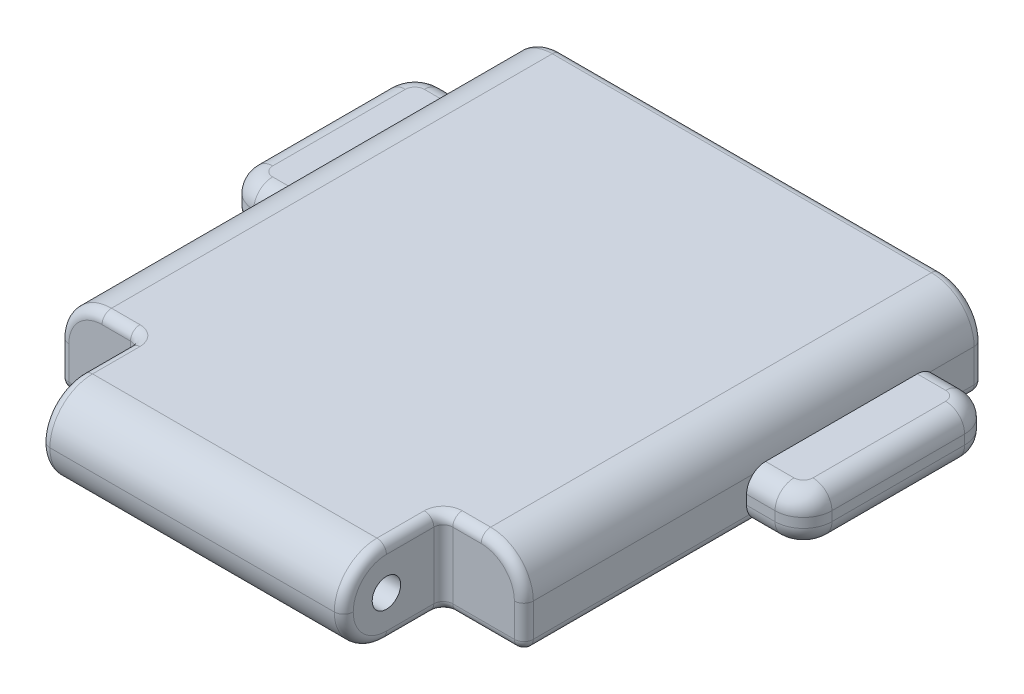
ISO-10303-21;
HEADER;
FILE_DESCRIPTION(('STEP AP214'),'2;1');
FILE_NAME('part.step','',(''),(''),'','','');
FILE_SCHEMA(('AUTOMOTIVE_DESIGN { 1 0 10303 214 1 1 1 1 }'));
ENDSEC;
DATA;
#1=APPLICATION_CONTEXT('core data for automotive mechanical design processes');
#2=APPLICATION_PROTOCOL_DEFINITION('international standard','automotive_design',2000,#1);
#3=PRODUCT_CONTEXT('',#1,'mechanical');
#4=PRODUCT('Part','Part','',(#3));
#5=PRODUCT_RELATED_PRODUCT_CATEGORY('part','',(#4));
#6=PRODUCT_DEFINITION_FORMATION('','',#4);
#7=PRODUCT_DEFINITION_CONTEXT('part definition',#1,'design');
#8=PRODUCT_DEFINITION('design','',#6,#7);
#9=PRODUCT_DEFINITION_SHAPE('','',#8);
#10=(LENGTH_UNIT() NAMED_UNIT(*) SI_UNIT(.MILLI.,.METRE.));
#11=(NAMED_UNIT(*) PLANE_ANGLE_UNIT() SI_UNIT($,.RADIAN.));
#12=(NAMED_UNIT(*) SI_UNIT($,.STERADIAN.) SOLID_ANGLE_UNIT());
#13=UNCERTAINTY_MEASURE_WITH_UNIT(LENGTH_MEASURE(1.E-05),#10,'distance_accuracy_value','');
#14=(GEOMETRIC_REPRESENTATION_CONTEXT(3) GLOBAL_UNCERTAINTY_ASSIGNED_CONTEXT((#13)) GLOBAL_UNIT_ASSIGNED_CONTEXT((#10,
#11,#12)) REPRESENTATION_CONTEXT('',''));
#15=CARTESIAN_POINT('',(0.,0.,0.));
#16=DIRECTION('',(0.,0.,1.));
#17=DIRECTION('',(1.,0.,0.));
#18=AXIS2_PLACEMENT_3D('',#15,#16,#17);
#19=CARTESIAN_POINT('',(42.,9.,0.));
#20=DIRECTION('',(-1.,0.,0.));
#21=DIRECTION('',(0.,0.,1.));
#22=AXIS2_PLACEMENT_3D('',#19,#20,#21);
#23=PLANE('',#22);
#24=DIRECTION('',(0.,0.,-1.));
#25=VECTOR('',#24,1.);
#26=CARTESIAN_POINT('',(42.,4.5,-9.5));
#27=LINE('',#26,#25);
#28=CARTESIAN_POINT('',(42.,4.5,-33.6771243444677));
#29=VERTEX_POINT('',#28);
#30=CARTESIAN_POINT('',(42.,4.5,-10.5));
#31=VERTEX_POINT('',#30);
#32=EDGE_CURVE('E753',#29,#31,#27,.F.);
#33=ORIENTED_EDGE('',*,*,#32,.T.);
#34=DIRECTION('',(0.,-1.,0.));
#35=VECTOR('',#34,1.);
#36=CARTESIAN_POINT('',(42.,9.,-10.5));
#37=LINE('',#36,#35);
#38=CARTESIAN_POINT('',(42.,0.999999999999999,-10.5));
#39=VERTEX_POINT('',#38);
#40=EDGE_CURVE('E496',#31,#39,#37,.T.);
#41=ORIENTED_EDGE('',*,*,#40,.T.);
#42=DIRECTION('',(0.,0.,-1.));
#43=VECTOR('',#42,1.);
#44=CARTESIAN_POINT('',(42.,0.999999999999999,0.));
#45=LINE('',#44,#43);
#46=CARTESIAN_POINT('',(42.,1.,-33.2679491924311));
#47=VERTEX_POINT('',#46);
#48=EDGE_CURVE('E486',#39,#47,#45,.T.);
#49=ORIENTED_EDGE('',*,*,#48,.T.);
#50=CARTESIAN_POINT('',(42.,2.,-35.));
#51=DIRECTION('',(-1.,0.,0.));
#52=DIRECTION('',(0.,0.,1.));
#53=AXIS2_PLACEMENT_3D('',#50,#51,#52);
#54=CIRCLE('',#53,2.);
#55=CARTESIAN_POINT('',(42.,2.,-33.));
#56=VERTEX_POINT('',#55);
#57=EDGE_CURVE('E854',#47,#56,#54,.T.);
#58=ORIENTED_EDGE('',*,*,#57,.T.);
#59=DIRECTION('',(0.,-1.,0.));
#60=VECTOR('',#59,1.);
#61=CARTESIAN_POINT('',(42.,5.,-33.));
#62=LINE('',#61,#60);
#63=CARTESIAN_POINT('',(42.,3.,-33.));
#64=VERTEX_POINT('',#63);
#65=EDGE_CURVE('E907',#64,#56,#62,.T.);
#66=ORIENTED_EDGE('',*,*,#65,.F.);
#67=CARTESIAN_POINT('',(42.,3.,-35.));
#68=DIRECTION('',(-1.,0.,0.));
#69=DIRECTION('',(0.,0.,1.));
#70=AXIS2_PLACEMENT_3D('',#67,#68,#69);
#71=CIRCLE('',#70,2.);
#72=EDGE_CURVE('E858',#64,#29,#71,.T.);
#73=ORIENTED_EDGE('',*,*,#72,.T.);
#74=EDGE_LOOP('',(#33,#41,#49,#58,#66,#73));
#75=FACE_BOUND('',#74,.T.);
#76=ADVANCED_FACE('F35',(#75),#23,.F.);
#77=CARTESIAN_POINT('',(-7.,9.,0.));
#78=DIRECTION('',(-1.,0.,0.));
#79=DIRECTION('',(0.,0.,1.));
#80=AXIS2_PLACEMENT_3D('',#77,#78,#79);
#81=PLANE('',#80);
#82=DIRECTION('',(0.,0.,-1.));
#83=VECTOR('',#82,1.);
#84=CARTESIAN_POINT('',(-7.,4.5,0.));
#85=LINE('',#84,#83);
#86=CARTESIAN_POINT('',(-7.,4.5,-52.3228756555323));
#87=VERTEX_POINT('',#86);
#88=CARTESIAN_POINT('',(-7.,4.5,-57.));
#89=VERTEX_POINT('',#88);
#90=EDGE_CURVE('E760',#87,#89,#85,.T.);
#91=ORIENTED_EDGE('',*,*,#90,.T.);
#92=DIRECTION('',(0.,-1.,0.));
#93=VECTOR('',#92,1.);
#94=CARTESIAN_POINT('',(-7.,9.,-57.));
#95=LINE('',#94,#93);
#96=CARTESIAN_POINT('',(-7.,1.,-57.));
#97=VERTEX_POINT('',#96);
#98=EDGE_CURVE('E617',#89,#97,#95,.T.);
#99=ORIENTED_EDGE('',*,*,#98,.T.);
#100=DIRECTION('',(0.,0.,-1.));
#101=VECTOR('',#100,1.);
#102=CARTESIAN_POINT('',(-7.,1.,-51.));
#103=LINE('',#102,#101);
#104=CARTESIAN_POINT('',(-7.,1.,-52.7320508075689));
#105=VERTEX_POINT('',#104);
#106=EDGE_CURVE('E615',#97,#105,#103,.F.);
#107=ORIENTED_EDGE('',*,*,#106,.T.);
#108=CARTESIAN_POINT('',(-7.,2.,-51.));
#109=DIRECTION('',(-1.,0.,0.));
#110=DIRECTION('',(0.,0.,1.));
#111=AXIS2_PLACEMENT_3D('',#108,#109,#110);
#112=CIRCLE('',#111,2.);
#113=CARTESIAN_POINT('',(-7.,2.,-53.));
#114=VERTEX_POINT('',#113);
#115=EDGE_CURVE('E864',#105,#114,#112,.F.);
#116=ORIENTED_EDGE('',*,*,#115,.T.);
#117=DIRECTION('',(0.,-1.,0.));
#118=VECTOR('',#117,1.);
#119=CARTESIAN_POINT('',(-7.,5.,-53.));
#120=LINE('',#119,#118);
#121=CARTESIAN_POINT('',(-7.,3.,-53.));
#122=VERTEX_POINT('',#121);
#123=EDGE_CURVE('E766',#122,#114,#120,.T.);
#124=ORIENTED_EDGE('',*,*,#123,.F.);
#125=CARTESIAN_POINT('',(-7.,3.,-51.));
#126=DIRECTION('',(-1.,0.,0.));
#127=DIRECTION('',(0.,0.,1.));
#128=AXIS2_PLACEMENT_3D('',#125,#126,#127);
#129=CIRCLE('',#128,2.);
#130=EDGE_CURVE('E478',#122,#87,#129,.F.);
#131=ORIENTED_EDGE('',*,*,#130,.T.);
#132=EDGE_LOOP('',(#91,#99,#107,#116,#124,#131));
#133=FACE_BOUND('',#132,.T.);
#134=ADVANCED_FACE('F671',(#133),#81,.T.);
#135=CARTESIAN_POINT('',(33.5,9.,0.));
#136=DIRECTION('',(-1.,0.,0.));
#137=DIRECTION('',(0.,0.,1.));
#138=AXIS2_PLACEMENT_3D('',#135,#136,#137);
#139=PLANE('',#138);
#140=DIRECTION('',(0.,0.,-1.));
#141=VECTOR('',#140,1.);
#142=CARTESIAN_POINT('',(33.5,0.999999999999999,0.));
#143=LINE('',#142,#141);
#144=CARTESIAN_POINT('',(33.5,1.,-3.5));
#145=VERTEX_POINT('',#144);
#146=CARTESIAN_POINT('',(33.5,0.999999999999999,-8.5));
#147=VERTEX_POINT('',#146);
#148=EDGE_CURVE('E593',#145,#147,#143,.T.);
#149=ORIENTED_EDGE('',*,*,#148,.T.);
#150=DIRECTION('',(0.,-1.,0.));
#151=VECTOR('',#150,1.);
#152=CARTESIAN_POINT('',(33.5,9.,-8.5));
#153=LINE('',#152,#151);
#154=CARTESIAN_POINT('',(33.5,8.,-8.5));
#155=VERTEX_POINT('',#154);
#156=EDGE_CURVE('E600',#147,#155,#153,.F.);
#157=ORIENTED_EDGE('',*,*,#156,.T.);
#158=DIRECTION('',(0.,0.,-1.));
#159=VECTOR('',#158,1.);
#160=CARTESIAN_POINT('',(33.5,8.,-3.5));
#161=LINE('',#160,#159);
#162=CARTESIAN_POINT('',(33.5,8.,-3.5));
#163=VERTEX_POINT('',#162);
#164=EDGE_CURVE('E597',#155,#163,#161,.F.);
#165=ORIENTED_EDGE('',*,*,#164,.T.);
#166=CARTESIAN_POINT('',(33.5,4.5,-3.5));
#167=DIRECTION('',(-1.,0.,0.));
#168=DIRECTION('',(0.,0.,1.));
#169=AXIS2_PLACEMENT_3D('',#166,#167,#168);
#170=CIRCLE('',#169,3.5);
#171=CARTESIAN_POINT('',(33.5,4.5,0.));
#172=VERTEX_POINT('',#171);
#173=EDGE_CURVE('E595',#163,#172,#170,.F.);
#174=ORIENTED_EDGE('',*,*,#173,.T.);
#175=CARTESIAN_POINT('',(33.5,4.5,-3.5));
#176=DIRECTION('',(-1.,0.,0.));
#177=DIRECTION('',(0.,0.,1.));
#178=AXIS2_PLACEMENT_3D('',#175,#176,#177);
#179=CIRCLE('',#178,3.5);
#180=EDGE_CURVE('E591',#172,#145,#179,.F.);
#181=ORIENTED_EDGE('',*,*,#180,.T.);
#182=EDGE_LOOP('',(#149,#157,#165,#174,#181));
#183=FACE_BOUND('',#182,.T.);
#184=CARTESIAN_POINT('',(33.5,4.5,-3.5));
#185=DIRECTION('',(-1.,0.,0.));
#186=DIRECTION('',(0.,0.,1.));
#187=AXIS2_PLACEMENT_3D('',#184,#185,#186);
#188=CIRCLE('',#187,1.5);
#189=CARTESIAN_POINT('',(33.5,4.5,-2.));
#190=VERTEX_POINT('',#189);
#191=EDGE_CURVE('E490',#190,#190,#188,.T.);
#192=ORIENTED_EDGE('',*,*,#191,.T.);
#193=EDGE_LOOP('',(#192));
#194=FACE_BOUND('',#193,.T.);
#195=ADVANCED_FACE('F678',(#183,#194),#139,.F.);
#196=CARTESIAN_POINT('',(0.,9.,-9.5));
#197=DIRECTION('',(0.,0.,-1.));
#198=DIRECTION('',(-1.,0.,0.));
#199=AXIS2_PLACEMENT_3D('',#196,#197,#198);
#200=PLANE('',#199);
#201=DIRECTION('',(0.,-1.,0.));
#202=VECTOR('',#201,1.);
#203=CARTESIAN_POINT('',(41.,9.,-9.5));
#204=LINE('',#203,#202);
#205=CARTESIAN_POINT('',(41.,0.999999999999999,-9.5));
#206=VERTEX_POINT('',#205);
#207=CARTESIAN_POINT('',(41.,4.5,-9.5));
#208=VERTEX_POINT('',#207);
#209=EDGE_CURVE('E505',#206,#208,#204,.F.);
#210=ORIENTED_EDGE('',*,*,#209,.T.);
#211=CARTESIAN_POINT('',(37.5,4.5,-9.5));
#212=DIRECTION('',(0.,0.,-1.));
#213=DIRECTION('',(-1.,0.,0.));
#214=AXIS2_PLACEMENT_3D('',#211,#212,#213);
#215=CIRCLE('',#214,3.5);
#216=CARTESIAN_POINT('',(37.5,8.,-9.5));
#217=VERTEX_POINT('',#216);
#218=EDGE_CURVE('E508',#208,#217,#215,.F.);
#219=ORIENTED_EDGE('',*,*,#218,.T.);
#220=DIRECTION('',(1.,0.,0.));
#221=VECTOR('',#220,1.);
#222=CARTESIAN_POINT('',(33.5,8.,-9.5));
#223=LINE('',#222,#221);
#224=CARTESIAN_POINT('',(34.5,8.,-9.5));
#225=VERTEX_POINT('',#224);
#226=EDGE_CURVE('E503',#217,#225,#223,.F.);
#227=ORIENTED_EDGE('',*,*,#226,.T.);
#228=DIRECTION('',(0.,-1.,0.));
#229=VECTOR('',#228,1.);
#230=CARTESIAN_POINT('',(34.5,0.,-9.5));
#231=LINE('',#230,#229);
#232=CARTESIAN_POINT('',(34.5,0.999999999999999,-9.5));
#233=VERTEX_POINT('',#232);
#234=EDGE_CURVE('E501',#225,#233,#231,.T.);
#235=ORIENTED_EDGE('',*,*,#234,.T.);
#236=DIRECTION('',(1.,0.,0.));
#237=VECTOR('',#236,1.);
#238=CARTESIAN_POINT('',(0.,0.999999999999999,-9.5));
#239=LINE('',#238,#237);
#240=EDGE_CURVE('E499',#233,#206,#239,.T.);
#241=ORIENTED_EDGE('',*,*,#240,.T.);
#242=EDGE_LOOP('',(#210,#219,#227,#235,#241));
#243=FACE_BOUND('',#242,.T.);
#244=ADVANCED_FACE('F687',(#243),#200,.F.);
#245=DIRECTION('',(0.,0.,-1.));
#246=VECTOR('',#245,1.);
#247=CARTESIAN_POINT('',(42.,0.999999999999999,0.));
#248=LINE('',#247,#246);
#249=CARTESIAN_POINT('',(42.,1.,-52.7320508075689));
#250=VERTEX_POINT('',#249);
#251=CARTESIAN_POINT('',(42.,0.999999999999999,-57.));
#252=VERTEX_POINT('',#251);
#253=EDGE_CURVE('E619',#250,#252,#248,.T.);
#254=ORIENTED_EDGE('',*,*,#253,.T.);
#255=DIRECTION('',(0.,-1.,0.));
#256=VECTOR('',#255,1.);
#257=CARTESIAN_POINT('',(42.,4.5,-57.));
#258=LINE('',#257,#256);
#259=CARTESIAN_POINT('',(42.,4.5,-57.));
#260=VERTEX_POINT('',#259);
#261=EDGE_CURVE('E621',#252,#260,#258,.F.);
#262=ORIENTED_EDGE('',*,*,#261,.T.);
#263=CARTESIAN_POINT('',(42.,4.5,-52.3228756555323));
#264=VERTEX_POINT('',#263);
#265=EDGE_CURVE('E743',#260,#264,#27,.F.);
#266=ORIENTED_EDGE('',*,*,#265,.T.);
#267=CARTESIAN_POINT('',(42.,3.,-51.));
#268=DIRECTION('',(-1.,0.,0.));
#269=DIRECTION('',(0.,0.,1.));
#270=AXIS2_PLACEMENT_3D('',#267,#268,#269);
#271=CIRCLE('',#270,2.);
#272=CARTESIAN_POINT('',(42.,3.,-53.));
#273=VERTEX_POINT('',#272);
#274=EDGE_CURVE('E856',#264,#273,#271,.T.);
#275=ORIENTED_EDGE('',*,*,#274,.T.);
#276=DIRECTION('',(0.,-1.,0.));
#277=VECTOR('',#276,1.);
#278=CARTESIAN_POINT('',(42.,5.,-53.));
#279=LINE('',#278,#277);
#280=CARTESIAN_POINT('',(42.,2.,-53.));
#281=VERTEX_POINT('',#280);
#282=EDGE_CURVE('E930',#273,#281,#279,.T.);
#283=ORIENTED_EDGE('',*,*,#282,.T.);
#284=CARTESIAN_POINT('',(42.,2.,-51.));
#285=DIRECTION('',(-1.,0.,0.));
#286=DIRECTION('',(0.,0.,1.));
#287=AXIS2_PLACEMENT_3D('',#284,#285,#286);
#288=CIRCLE('',#287,2.);
#289=EDGE_CURVE('E702',#281,#250,#288,.T.);
#290=ORIENTED_EDGE('',*,*,#289,.T.);
#291=EDGE_LOOP('',(#254,#262,#266,#275,#283,#290));
#292=FACE_BOUND('',#291,.T.);
#293=ADVANCED_FACE('F674',(#292),#23,.F.);
#294=CARTESIAN_POINT('',(0.,9.,-58.));
#295=DIRECTION('',(0.,0.,-1.));
#296=DIRECTION('',(-1.,0.,0.));
#297=AXIS2_PLACEMENT_3D('',#294,#295,#296);
#298=PLANE('',#297);
#299=DIRECTION('',(0.,-1.,0.));
#300=VECTOR('',#299,1.);
#301=CARTESIAN_POINT('',(-6.,9.,-58.));
#302=LINE('',#301,#300);
#303=CARTESIAN_POINT('',(-6.,1.,-58.));
#304=VERTEX_POINT('',#303);
#305=CARTESIAN_POINT('',(-6.,4.5,-58.));
#306=VERTEX_POINT('',#305);
#307=EDGE_CURVE('E610',#304,#306,#302,.F.);
#308=ORIENTED_EDGE('',*,*,#307,.T.);
#309=CARTESIAN_POINT('',(-2.5,4.5,-58.));
#310=DIRECTION('',(0.,0.,-1.));
#311=DIRECTION('',(-1.,0.,0.));
#312=AXIS2_PLACEMENT_3D('',#309,#310,#311);
#313=CIRCLE('',#312,3.5);
#314=CARTESIAN_POINT('',(-2.5,8.,-58.));
#315=VERTEX_POINT('',#314);
#316=EDGE_CURVE('E612',#306,#315,#313,.T.);
#317=ORIENTED_EDGE('',*,*,#316,.T.);
#318=DIRECTION('',(1.,0.,0.));
#319=VECTOR('',#318,1.);
#320=CARTESIAN_POINT('',(0.,8.,-58.));
#321=LINE('',#320,#319);
#322=CARTESIAN_POINT('',(37.5,8.,-58.));
#323=VERTEX_POINT('',#322);
#324=EDGE_CURVE('E602',#315,#323,#321,.T.);
#325=ORIENTED_EDGE('',*,*,#324,.T.);
#326=CARTESIAN_POINT('',(37.5,4.5,-58.));
#327=DIRECTION('',(0.,0.,-1.));
#328=DIRECTION('',(-1.,0.,0.));
#329=AXIS2_PLACEMENT_3D('',#326,#327,#328);
#330=CIRCLE('',#329,3.5);
#331=CARTESIAN_POINT('',(41.,4.5,-58.));
#332=VERTEX_POINT('',#331);
#333=EDGE_CURVE('E604',#323,#332,#330,.T.);
#334=ORIENTED_EDGE('',*,*,#333,.T.);
#335=DIRECTION('',(0.,-1.,0.));
#336=VECTOR('',#335,1.);
#337=CARTESIAN_POINT('',(41.,0.,-58.));
#338=LINE('',#337,#336);
#339=CARTESIAN_POINT('',(41.,1.,-58.));
#340=VERTEX_POINT('',#339);
#341=EDGE_CURVE('E606',#332,#340,#338,.T.);
#342=ORIENTED_EDGE('',*,*,#341,.T.);
#343=DIRECTION('',(1.,0.,0.));
#344=VECTOR('',#343,1.);
#345=CARTESIAN_POINT('',(-7.,1.,-58.));
#346=LINE('',#345,#344);
#347=EDGE_CURVE('E608',#340,#304,#346,.F.);
#348=ORIENTED_EDGE('',*,*,#347,.T.);
#349=EDGE_LOOP('',(#308,#317,#325,#334,#342,#348));
#350=FACE_BOUND('',#349,.T.);
#351=DIRECTION('',(-1.,0.,0.));
#352=VECTOR('',#351,1.);
#353=CARTESIAN_POINT('',(0.,3.1,-58.));
#354=LINE('',#353,#352);
#355=CARTESIAN_POINT('',(12.5,3.1,-58.));
#356=VERTEX_POINT('',#355);
#357=CARTESIAN_POINT('',(22.5,3.1,-58.));
#358=VERTEX_POINT('',#357);
#359=EDGE_CURVE('E475',#356,#358,#354,.F.);
#360=ORIENTED_EDGE('',*,*,#359,.T.);
#361=CARTESIAN_POINT('',(22.5,4.5,-58.));
#362=DIRECTION('',(0.,0.,-1.));
#363=DIRECTION('',(-1.,0.,0.));
#364=AXIS2_PLACEMENT_3D('',#361,#362,#363);
#365=CIRCLE('',#364,1.4);
#366=CARTESIAN_POINT('',(22.5,5.9,-58.));
#367=VERTEX_POINT('',#366);
#368=EDGE_CURVE('E483',#358,#367,#365,.F.);
#369=ORIENTED_EDGE('',*,*,#368,.T.);
#370=DIRECTION('',(1.,0.,0.));
#371=VECTOR('',#370,1.);
#372=CARTESIAN_POINT('',(0.,5.9,-58.));
#373=LINE('',#372,#371);
#374=CARTESIAN_POINT('',(12.5,5.9,-58.));
#375=VERTEX_POINT('',#374);
#376=EDGE_CURVE('E480',#367,#375,#373,.F.);
#377=ORIENTED_EDGE('',*,*,#376,.T.);
#378=CARTESIAN_POINT('',(12.5,4.5,-58.));
#379=DIRECTION('',(0.,0.,-1.));
#380=DIRECTION('',(-1.,0.,0.));
#381=AXIS2_PLACEMENT_3D('',#378,#379,#380);
#382=CIRCLE('',#381,1.4);
#383=EDGE_CURVE('E477',#375,#356,#382,.F.);
#384=ORIENTED_EDGE('',*,*,#383,.T.);
#385=EDGE_LOOP('',(#360,#369,#377,#384));
#386=FACE_BOUND('',#385,.T.);
#387=ADVANCED_FACE('F686',(#350,#386),#298,.T.);
#388=DIRECTION('',(0.,0.,-1.));
#389=VECTOR('',#388,1.);
#390=CARTESIAN_POINT('',(-7.,1.,-9.5));
#391=LINE('',#390,#389);
#392=CARTESIAN_POINT('',(-7.,1.,-33.2679491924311));
#393=VERTEX_POINT('',#392);
#394=CARTESIAN_POINT('',(-7.,1.,-10.5));
#395=VERTEX_POINT('',#394);
#396=EDGE_CURVE('E582',#393,#395,#391,.F.);
#397=ORIENTED_EDGE('',*,*,#396,.T.);
#398=DIRECTION('',(0.,-1.,0.));
#399=VECTOR('',#398,1.);
#400=CARTESIAN_POINT('',(-7.,4.5,-10.5));
#401=LINE('',#400,#399);
#402=CARTESIAN_POINT('',(-7.,4.5,-10.5));
#403=VERTEX_POINT('',#402);
#404=EDGE_CURVE('E584',#395,#403,#401,.F.);
#405=ORIENTED_EDGE('',*,*,#404,.T.);
#406=CARTESIAN_POINT('',(-7.,4.5,-33.6771243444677));
#407=VERTEX_POINT('',#406);
#408=EDGE_CURVE('E449',#403,#407,#85,.T.);
#409=ORIENTED_EDGE('',*,*,#408,.T.);
#410=CARTESIAN_POINT('',(-7.,3.,-35.));
#411=DIRECTION('',(-1.,0.,0.));
#412=DIRECTION('',(0.,0.,1.));
#413=AXIS2_PLACEMENT_3D('',#410,#411,#412);
#414=CIRCLE('',#413,2.);
#415=CARTESIAN_POINT('',(-7.,3.,-33.));
#416=VERTEX_POINT('',#415);
#417=EDGE_CURVE('E866',#407,#416,#414,.F.);
#418=ORIENTED_EDGE('',*,*,#417,.T.);
#419=DIRECTION('',(0.,-1.,0.));
#420=VECTOR('',#419,1.);
#421=CARTESIAN_POINT('',(-7.,5.,-33.));
#422=LINE('',#421,#420);
#423=CARTESIAN_POINT('',(-7.,2.,-33.));
#424=VERTEX_POINT('',#423);
#425=EDGE_CURVE('E915',#416,#424,#422,.T.);
#426=ORIENTED_EDGE('',*,*,#425,.T.);
#427=CARTESIAN_POINT('',(-7.,2.,-35.));
#428=DIRECTION('',(-1.,0.,0.));
#429=DIRECTION('',(0.,0.,1.));
#430=AXIS2_PLACEMENT_3D('',#427,#428,#429);
#431=CIRCLE('',#430,2.);
#432=EDGE_CURVE('E861',#424,#393,#431,.F.);
#433=ORIENTED_EDGE('',*,*,#432,.T.);
#434=EDGE_LOOP('',(#397,#405,#409,#418,#426,#433));
#435=FACE_BOUND('',#434,.T.);
#436=ADVANCED_FACE('F681',(#435),#81,.T.);
#437=CARTESIAN_POINT('',(0.,9.,-9.5));
#438=DIRECTION('',(0.,0.,-1.));
#439=DIRECTION('',(-1.,0.,0.));
#440=AXIS2_PLACEMENT_3D('',#437,#438,#439);
#441=PLANE('',#440);
#442=DIRECTION('',(0.,-1.,0.));
#443=VECTOR('',#442,1.);
#444=CARTESIAN_POINT('',(-6.,0.,-9.5));
#445=LINE('',#444,#443);
#446=CARTESIAN_POINT('',(-6.,4.5,-9.5));
#447=VERTEX_POINT('',#446);
#448=CARTESIAN_POINT('',(-6.,0.999999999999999,-9.5));
#449=VERTEX_POINT('',#448);
#450=EDGE_CURVE('E577',#447,#449,#445,.T.);
#451=ORIENTED_EDGE('',*,*,#450,.T.);
#452=DIRECTION('',(1.,0.,0.));
#453=VECTOR('',#452,1.);
#454=CARTESIAN_POINT('',(0.,0.999999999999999,-9.5));
#455=LINE('',#454,#453);
#456=CARTESIAN_POINT('',(0.500000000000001,0.999999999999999,-9.5));
#457=VERTEX_POINT('',#456);
#458=EDGE_CURVE('E580',#449,#457,#455,.T.);
#459=ORIENTED_EDGE('',*,*,#458,.T.);
#460=DIRECTION('',(0.,-1.,0.));
#461=VECTOR('',#460,1.);
#462=CARTESIAN_POINT('',(0.500000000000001,9.,-9.5));
#463=LINE('',#462,#461);
#464=CARTESIAN_POINT('',(0.500000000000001,8.,-9.5));
#465=VERTEX_POINT('',#464);
#466=EDGE_CURVE('E573',#457,#465,#463,.F.);
#467=ORIENTED_EDGE('',*,*,#466,.T.);
#468=DIRECTION('',(1.,0.,0.));
#469=VECTOR('',#468,1.);
#470=CARTESIAN_POINT('',(-2.5,8.,-9.5));
#471=LINE('',#470,#469);
#472=CARTESIAN_POINT('',(-2.5,8.,-9.5));
#473=VERTEX_POINT('',#472);
#474=EDGE_CURVE('E571',#465,#473,#471,.F.);
#475=ORIENTED_EDGE('',*,*,#474,.T.);
#476=CARTESIAN_POINT('',(-2.5,4.5,-9.5));
#477=DIRECTION('',(0.,0.,-1.));
#478=DIRECTION('',(-1.,0.,0.));
#479=AXIS2_PLACEMENT_3D('',#476,#477,#478);
#480=CIRCLE('',#479,3.5);
#481=EDGE_CURVE('E575',#473,#447,#480,.F.);
#482=ORIENTED_EDGE('',*,*,#481,.T.);
#483=EDGE_LOOP('',(#451,#459,#467,#475,#482));
#484=FACE_BOUND('',#483,.T.);
#485=ADVANCED_FACE('F1140',(#484),#441,.F.);
#486=CARTESIAN_POINT('',(1.5,9.,0.));
#487=DIRECTION('',(-1.,0.,0.));
#488=DIRECTION('',(0.,0.,1.));
#489=AXIS2_PLACEMENT_3D('',#486,#487,#488);
#490=PLANE('',#489);
#491=DIRECTION('',(0.,-1.,0.));
#492=VECTOR('',#491,1.);
#493=CARTESIAN_POINT('',(1.5,9.,-8.5));
#494=LINE('',#493,#492);
#495=CARTESIAN_POINT('',(1.5,8.,-8.5));
#496=VERTEX_POINT('',#495);
#497=CARTESIAN_POINT('',(1.5,1.,-8.5));
#498=VERTEX_POINT('',#497);
#499=EDGE_CURVE('E554',#496,#498,#494,.T.);
#500=ORIENTED_EDGE('',*,*,#499,.T.);
#501=DIRECTION('',(0.,0.,-1.));
#502=VECTOR('',#501,1.);
#503=CARTESIAN_POINT('',(1.5,1.,-3.5));
#504=LINE('',#503,#502);
#505=CARTESIAN_POINT('',(1.5,1.,-3.5));
#506=VERTEX_POINT('',#505);
#507=EDGE_CURVE('E560',#498,#506,#504,.F.);
#508=ORIENTED_EDGE('',*,*,#507,.T.);
#509=CARTESIAN_POINT('',(1.5,4.5,-3.5));
#510=DIRECTION('',(-1.,0.,0.));
#511=DIRECTION('',(0.,0.,1.));
#512=AXIS2_PLACEMENT_3D('',#509,#510,#511);
#513=CIRCLE('',#512,3.5);
#514=CARTESIAN_POINT('',(1.5,4.5,0.));
#515=VERTEX_POINT('',#514);
#516=EDGE_CURVE('E558',#506,#515,#513,.T.);
#517=ORIENTED_EDGE('',*,*,#516,.T.);
#518=CARTESIAN_POINT('',(1.5,4.5,-3.5));
#519=DIRECTION('',(-1.,0.,0.));
#520=DIRECTION('',(0.,0.,1.));
#521=AXIS2_PLACEMENT_3D('',#518,#519,#520);
#522=CIRCLE('',#521,3.5);
#523=CARTESIAN_POINT('',(1.5,8.,-3.5));
#524=VERTEX_POINT('',#523);
#525=EDGE_CURVE('E556',#515,#524,#522,.T.);
#526=ORIENTED_EDGE('',*,*,#525,.T.);
#527=DIRECTION('',(0.,0.,-1.));
#528=VECTOR('',#527,1.);
#529=CARTESIAN_POINT('',(1.5,8.,0.));
#530=LINE('',#529,#528);
#531=EDGE_CURVE('E552',#524,#496,#530,.T.);
#532=ORIENTED_EDGE('',*,*,#531,.T.);
#533=EDGE_LOOP('',(#500,#508,#517,#526,#532));
#534=FACE_BOUND('',#533,.T.);
#535=CARTESIAN_POINT('',(1.5,4.5,-3.5));
#536=DIRECTION('',(-1.,0.,0.));
#537=DIRECTION('',(0.,0.,1.));
#538=AXIS2_PLACEMENT_3D('',#535,#536,#537);
#539=CIRCLE('',#538,1.5);
#540=CARTESIAN_POINT('',(1.50000000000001,4.5,-2.));
#541=VERTEX_POINT('',#540);
#542=EDGE_CURVE('E1325',#541,#541,#539,.T.);
#543=ORIENTED_EDGE('',*,*,#542,.F.);
#544=EDGE_LOOP('',(#543));
#545=FACE_BOUND('',#544,.T.);
#546=ADVANCED_FACE('F1134',(#534,#545),#490,.T.);
#547=CARTESIAN_POINT('',(0.,9.,0.));
#548=DIRECTION('',(0.,1.,0.));
#549=DIRECTION('',(0.,0.,1.));
#550=AXIS2_PLACEMENT_3D('',#547,#548,#549);
#551=PLANE('',#550);
#552=CARTESIAN_POINT('',(34.5,9.,-8.5));
#553=DIRECTION('',(0.,1.,0.));
#554=DIRECTION('',(0.,0.,1.));
#555=AXIS2_PLACEMENT_3D('',#552,#553,#554);
#556=CIRCLE('',#555,2.);
#557=CARTESIAN_POINT('',(34.5,9.,-10.5));
#558=VERTEX_POINT('',#557);
#559=CARTESIAN_POINT('',(32.5,9.,-8.5));
#560=VERTEX_POINT('',#559);
#561=EDGE_CURVE('E519',#558,#560,#556,.T.);
#562=ORIENTED_EDGE('',*,*,#561,.F.);
#563=DIRECTION('',(1.,0.,0.));
#564=VECTOR('',#563,1.);
#565=CARTESIAN_POINT('',(37.5,9.,-10.5));
#566=LINE('',#565,#564);
#567=CARTESIAN_POINT('',(37.5,9.,-10.5));
#568=VERTEX_POINT('',#567);
#569=EDGE_CURVE('E524',#558,#568,#566,.T.);
#570=ORIENTED_EDGE('',*,*,#569,.T.);
#571=DIRECTION('',(0.,0.,-1.));
#572=VECTOR('',#571,1.);
#573=CARTESIAN_POINT('',(37.5,9.,-58.));
#574=LINE('',#573,#572);
#575=CARTESIAN_POINT('',(37.5,9.,-57.));
#576=VERTEX_POINT('',#575);
#577=EDGE_CURVE('E740',#568,#576,#574,.T.);
#578=ORIENTED_EDGE('',*,*,#577,.T.);
#579=DIRECTION('',(1.,0.,0.));
#580=VECTOR('',#579,1.);
#581=CARTESIAN_POINT('',(0.,9.,-57.));
#582=LINE('',#581,#580);
#583=CARTESIAN_POINT('',(-2.5,9.,-57.));
#584=VERTEX_POINT('',#583);
#585=EDGE_CURVE('E517',#576,#584,#582,.F.);
#586=ORIENTED_EDGE('',*,*,#585,.T.);
#587=DIRECTION('',(0.,0.,-1.));
#588=VECTOR('',#587,1.);
#589=CARTESIAN_POINT('',(-2.5,9.,0.));
#590=LINE('',#589,#588);
#591=CARTESIAN_POINT('',(-2.5,9.,-10.5));
#592=VERTEX_POINT('',#591);
#593=EDGE_CURVE('E750',#584,#592,#590,.F.);
#594=ORIENTED_EDGE('',*,*,#593,.T.);
#595=DIRECTION('',(1.,0.,0.));
#596=VECTOR('',#595,1.);
#597=CARTESIAN_POINT('',(1.5,9.,-10.5));
#598=LINE('',#597,#596);
#599=CARTESIAN_POINT('',(0.500000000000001,9.,-10.5));
#600=VERTEX_POINT('',#599);
#601=EDGE_CURVE('E513',#592,#600,#598,.T.);
#602=ORIENTED_EDGE('',*,*,#601,.T.);
#603=CARTESIAN_POINT('',(0.500000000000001,9.,-8.5));
#604=DIRECTION('',(0.,1.,0.));
#605=DIRECTION('',(0.,0.,1.));
#606=AXIS2_PLACEMENT_3D('',#603,#604,#605);
#607=CIRCLE('',#606,2.);
#608=CARTESIAN_POINT('',(2.5,9.,-8.5));
#609=VERTEX_POINT('',#608);
#610=EDGE_CURVE('E510',#609,#600,#607,.T.);
#611=ORIENTED_EDGE('',*,*,#610,.F.);
#612=DIRECTION('',(0.,0.,-1.));
#613=VECTOR('',#612,1.);
#614=CARTESIAN_POINT('',(2.5,9.,0.));
#615=LINE('',#614,#613);
#616=CARTESIAN_POINT('',(2.5,9.,-3.5));
#617=VERTEX_POINT('',#616);
#618=EDGE_CURVE('E515',#609,#617,#615,.F.);
#619=ORIENTED_EDGE('',*,*,#618,.T.);
#620=DIRECTION('',(1.,0.,0.));
#621=VECTOR('',#620,1.);
#622=CARTESIAN_POINT('',(33.5,9.,-3.5));
#623=LINE('',#622,#621);
#624=CARTESIAN_POINT('',(32.5,9.,-3.5));
#625=VERTEX_POINT('',#624);
#626=EDGE_CURVE('E749',#617,#625,#623,.T.);
#627=ORIENTED_EDGE('',*,*,#626,.T.);
#628=DIRECTION('',(0.,0.,-1.));
#629=VECTOR('',#628,1.);
#630=CARTESIAN_POINT('',(32.5,9.,-9.5));
#631=LINE('',#630,#629);
#632=EDGE_CURVE('E522',#625,#560,#631,.T.);
#633=ORIENTED_EDGE('',*,*,#632,.T.);
#634=EDGE_LOOP('',(#562,#570,#578,#586,#594,#602,#611,#619,#627,#633));
#635=FACE_BOUND('',#634,.T.);
#636=ADVANCED_FACE('F745',(#635),#551,.T.);
#637=CARTESIAN_POINT('',(0.,0.,0.));
#638=DIRECTION('',(0.,1.,0.));
#639=DIRECTION('',(0.,0.,1.));
#640=AXIS2_PLACEMENT_3D('',#637,#638,#639);
#641=PLANE('',#640);
#642=CARTESIAN_POINT('',(34.5,0.,-8.5));
#643=DIRECTION('',(0.,1.,0.));
#644=DIRECTION('',(0.,0.,1.));
#645=AXIS2_PLACEMENT_3D('',#642,#643,#644);
#646=CIRCLE('',#645,2.);
#647=CARTESIAN_POINT('',(32.5,0.,-8.5));
#648=VERTEX_POINT('',#647);
#649=CARTESIAN_POINT('',(34.5,0.,-10.5));
#650=VERTEX_POINT('',#649);
#651=EDGE_CURVE('E547',#648,#650,#646,.F.);
#652=ORIENTED_EDGE('',*,*,#651,.F.);
#653=DIRECTION('',(0.,0.,-1.));
#654=VECTOR('',#653,1.);
#655=CARTESIAN_POINT('',(32.5,0.,0.));
#656=LINE('',#655,#654);
#657=CARTESIAN_POINT('',(32.5,0.,-3.5));
#658=VERTEX_POINT('',#657);
#659=EDGE_CURVE('E550',#648,#658,#656,.F.);
#660=ORIENTED_EDGE('',*,*,#659,.T.);
#661=DIRECTION('',(1.,0.,0.));
#662=VECTOR('',#661,1.);
#663=CARTESIAN_POINT('',(0.,0.,-3.5));
#664=LINE('',#663,#662);
#665=CARTESIAN_POINT('',(2.5,0.,-3.5));
#666=VERTEX_POINT('',#665);
#667=EDGE_CURVE('E755',#658,#666,#664,.F.);
#668=ORIENTED_EDGE('',*,*,#667,.T.);
#669=DIRECTION('',(0.,0.,-1.));
#670=VECTOR('',#669,1.);
#671=CARTESIAN_POINT('',(2.5,0.,-9.5));
#672=LINE('',#671,#670);
#673=CARTESIAN_POINT('',(2.5,0.,-8.5));
#674=VERTEX_POINT('',#673);
#675=EDGE_CURVE('E540',#666,#674,#672,.T.);
#676=ORIENTED_EDGE('',*,*,#675,.T.);
#677=CARTESIAN_POINT('',(0.500000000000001,0.,-8.5));
#678=DIRECTION('',(0.,1.,0.));
#679=DIRECTION('',(0.,0.,1.));
#680=AXIS2_PLACEMENT_3D('',#677,#678,#679);
#681=CIRCLE('',#680,2.);
#682=CARTESIAN_POINT('',(0.500000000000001,0.,-10.5));
#683=VERTEX_POINT('',#682);
#684=EDGE_CURVE('E537',#683,#674,#681,.F.);
#685=ORIENTED_EDGE('',*,*,#684,.F.);
#686=DIRECTION('',(1.,0.,0.));
#687=VECTOR('',#686,1.);
#688=CARTESIAN_POINT('',(0.,0.,-10.5));
#689=LINE('',#688,#687);
#690=CARTESIAN_POINT('',(-6.,0.,-10.5));
#691=VERTEX_POINT('',#690);
#692=EDGE_CURVE('E535',#683,#691,#689,.F.);
#693=ORIENTED_EDGE('',*,*,#692,.T.);
#694=DIRECTION('',(0.,0.,-1.));
#695=VECTOR('',#694,1.);
#696=CARTESIAN_POINT('',(-6.,0.,-35.));
#697=LINE('',#696,#695);
#698=CARTESIAN_POINT('',(-6.,0.,-35.));
#699=VERTEX_POINT('',#698);
#700=EDGE_CURVE('E533',#691,#699,#697,.T.);
#701=ORIENTED_EDGE('',*,*,#700,.T.);
#702=DIRECTION('',(-1.,0.,0.));
#703=VECTOR('',#702,1.);
#704=CARTESIAN_POINT('',(-10.,0.,-35.));
#705=LINE('',#704,#703);
#706=CARTESIAN_POINT('',(-10.,0.,-35.));
#707=VERTEX_POINT('',#706);
#708=EDGE_CURVE('E433',#699,#707,#705,.T.);
#709=ORIENTED_EDGE('',*,*,#708,.T.);
#710=CARTESIAN_POINT('',(-10.,0.,-36.));
#711=DIRECTION('',(0.,1.,0.));
#712=DIRECTION('',(0.,0.,1.));
#713=AXIS2_PLACEMENT_3D('',#710,#711,#712);
#714=CIRCLE('',#713,1.);
#715=CARTESIAN_POINT('',(-11.,0.,-36.));
#716=VERTEX_POINT('',#715);
#717=EDGE_CURVE('E427',#707,#716,#714,.F.);
#718=ORIENTED_EDGE('',*,*,#717,.T.);
#719=DIRECTION('',(0.,0.,-1.));
#720=VECTOR('',#719,1.);
#721=CARTESIAN_POINT('',(-11.,0.,-50.));
#722=LINE('',#721,#720);
#723=CARTESIAN_POINT('',(-11.,0.,-50.));
#724=VERTEX_POINT('',#723);
#725=EDGE_CURVE('E430',#716,#724,#722,.T.);
#726=ORIENTED_EDGE('',*,*,#725,.T.);
#727=CARTESIAN_POINT('',(-10.,0.,-50.));
#728=DIRECTION('',(0.,1.,0.));
#729=DIRECTION('',(0.,0.,1.));
#730=AXIS2_PLACEMENT_3D('',#727,#728,#729);
#731=CIRCLE('',#730,0.999999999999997);
#732=CARTESIAN_POINT('',(-9.99999999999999,0.,-51.));
#733=VERTEX_POINT('',#732);
#734=EDGE_CURVE('E448',#724,#733,#731,.F.);
#735=ORIENTED_EDGE('',*,*,#734,.T.);
#736=DIRECTION('',(1.,0.,0.));
#737=VECTOR('',#736,1.);
#738=CARTESIAN_POINT('',(-6.99999999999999,0.,-51.));
#739=LINE('',#738,#737);
#740=CARTESIAN_POINT('',(-6.,0.,-51.));
#741=VERTEX_POINT('',#740);
#742=EDGE_CURVE('E437',#733,#741,#739,.T.);
#743=ORIENTED_EDGE('',*,*,#742,.T.);
#744=DIRECTION('',(0.,0.,-1.));
#745=VECTOR('',#744,1.);
#746=CARTESIAN_POINT('',(-6.,0.,-58.));
#747=LINE('',#746,#745);
#748=CARTESIAN_POINT('',(-6.,0.,-57.));
#749=VERTEX_POINT('',#748);
#750=EDGE_CURVE('E526',#741,#749,#747,.T.);
#751=ORIENTED_EDGE('',*,*,#750,.T.);
#752=DIRECTION('',(1.,0.,0.));
#753=VECTOR('',#752,1.);
#754=CARTESIAN_POINT('',(42.,0.,-57.));
#755=LINE('',#754,#753);
#756=CARTESIAN_POINT('',(41.,0.,-57.));
#757=VERTEX_POINT('',#756);
#758=EDGE_CURVE('E528',#749,#757,#755,.T.);
#759=ORIENTED_EDGE('',*,*,#758,.T.);
#760=DIRECTION('',(0.,0.,-1.));
#761=VECTOR('',#760,1.);
#762=CARTESIAN_POINT('',(41.,0.,0.));
#763=LINE('',#762,#761);
#764=CARTESIAN_POINT('',(41.,0.,-51.));
#765=VERTEX_POINT('',#764);
#766=EDGE_CURVE('E530',#757,#765,#763,.F.);
#767=ORIENTED_EDGE('',*,*,#766,.T.);
#768=DIRECTION('',(1.,0.,0.));
#769=VECTOR('',#768,1.);
#770=CARTESIAN_POINT('',(45.,0.,-51.));
#771=LINE('',#770,#769);
#772=CARTESIAN_POINT('',(45.,0.,-51.));
#773=VERTEX_POINT('',#772);
#774=EDGE_CURVE('E779',#765,#773,#771,.T.);
#775=ORIENTED_EDGE('',*,*,#774,.T.);
#776=CARTESIAN_POINT('',(45.,0.,-50.));
#777=DIRECTION('',(0.,1.,0.));
#778=DIRECTION('',(0.,0.,1.));
#779=AXIS2_PLACEMENT_3D('',#776,#777,#778);
#780=CIRCLE('',#779,0.999999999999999);
#781=CARTESIAN_POINT('',(46.,0.,-50.));
#782=VERTEX_POINT('',#781);
#783=EDGE_CURVE('E777',#773,#782,#780,.F.);
#784=ORIENTED_EDGE('',*,*,#783,.T.);
#785=DIRECTION('',(0.,0.,1.));
#786=VECTOR('',#785,1.);
#787=CARTESIAN_POINT('',(46.,0.,-36.));
#788=LINE('',#787,#786);
#789=CARTESIAN_POINT('',(46.,0.,-36.));
#790=VERTEX_POINT('',#789);
#791=EDGE_CURVE('E771',#782,#790,#788,.T.);
#792=ORIENTED_EDGE('',*,*,#791,.T.);
#793=CARTESIAN_POINT('',(45.,0.,-36.));
#794=DIRECTION('',(0.,1.,0.));
#795=DIRECTION('',(0.,0.,1.));
#796=AXIS2_PLACEMENT_3D('',#793,#794,#795);
#797=CIRCLE('',#796,1.);
#798=CARTESIAN_POINT('',(45.,0.,-35.));
#799=VERTEX_POINT('',#798);
#800=EDGE_CURVE('E773',#790,#799,#797,.F.);
#801=ORIENTED_EDGE('',*,*,#800,.T.);
#802=DIRECTION('',(-1.,0.,0.));
#803=VECTOR('',#802,1.);
#804=CARTESIAN_POINT('',(42.,0.,-35.));
#805=LINE('',#804,#803);
#806=CARTESIAN_POINT('',(41.,0.,-35.));
#807=VERTEX_POINT('',#806);
#808=EDGE_CURVE('E775',#799,#807,#805,.T.);
#809=ORIENTED_EDGE('',*,*,#808,.T.);
#810=DIRECTION('',(0.,0.,-1.));
#811=VECTOR('',#810,1.);
#812=CARTESIAN_POINT('',(41.,0.,0.));
#813=LINE('',#812,#811);
#814=CARTESIAN_POINT('',(41.,0.,-10.5));
#815=VERTEX_POINT('',#814);
#816=EDGE_CURVE('E543',#807,#815,#813,.F.);
#817=ORIENTED_EDGE('',*,*,#816,.T.);
#818=DIRECTION('',(1.,0.,0.));
#819=VECTOR('',#818,1.);
#820=CARTESIAN_POINT('',(0.,0.,-10.5));
#821=LINE('',#820,#819);
#822=EDGE_CURVE('E545',#815,#650,#821,.F.);
#823=ORIENTED_EDGE('',*,*,#822,.T.);
#824=EDGE_LOOP('',(#652,#660,#668,#676,#685,#693,#701,#709,#718,#726,#735,#743,#751,#759,#767,
#775,#784,#792,#801,#809,#817,#823));
#825=FACE_BOUND('',#824,.T.);
#826=ADVANCED_FACE('F429',(#825),#641,.F.);
#827=CARTESIAN_POINT('',(0.,4.5,-3.5));
#828=DIRECTION('',(-1.,0.,0.));
#829=DIRECTION('',(0.,0.,1.));
#830=AXIS2_PLACEMENT_3D('',#827,#828,#829);
#831=CYLINDRICAL_SURFACE('',#830,4.5);
#832=ORIENTED_EDGE('',*,*,#626,.F.);
#833=CARTESIAN_POINT('',(2.5,4.5,-3.5));
#834=DIRECTION('',(-1.,0.,0.));
#835=DIRECTION('',(0.,0.,1.));
#836=AXIS2_PLACEMENT_3D('',#833,#834,#835);
#837=CIRCLE('',#836,4.5);
#838=CARTESIAN_POINT('',(2.5,4.5,0.999999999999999));
#839=VERTEX_POINT('',#838);
#840=EDGE_CURVE('E569',#617,#839,#837,.F.);
#841=ORIENTED_EDGE('',*,*,#840,.T.);
#842=DIRECTION('',(1.,0.,0.));
#843=VECTOR('',#842,1.);
#844=CARTESIAN_POINT('',(1.5,4.5,0.999999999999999));
#845=LINE('',#844,#843);
#846=CARTESIAN_POINT('',(32.5,4.5,0.999999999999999));
#847=VERTEX_POINT('',#846);
#848=EDGE_CURVE('E764',#847,#839,#845,.F.);
#849=ORIENTED_EDGE('',*,*,#848,.F.);
#850=CARTESIAN_POINT('',(32.5,4.5,-3.5));
#851=DIRECTION('',(-1.,0.,0.));
#852=DIRECTION('',(0.,0.,1.));
#853=AXIS2_PLACEMENT_3D('',#850,#851,#852);
#854=CIRCLE('',#853,4.5);
#855=EDGE_CURVE('E567',#847,#625,#854,.T.);
#856=ORIENTED_EDGE('',*,*,#855,.T.);
#857=EDGE_LOOP('',(#832,#841,#849,#856));
#858=FACE_BOUND('',#857,.T.);
#859=ADVANCED_FACE('F1137',(#858),#831,.T.);
#860=CARTESIAN_POINT('',(0.,4.5,-3.5));
#861=DIRECTION('',(1.,0.,0.));
#862=DIRECTION('',(0.,0.,-1.));
#863=AXIS2_PLACEMENT_3D('',#860,#861,#862);
#864=CYLINDRICAL_SURFACE('',#863,4.5);
#865=ORIENTED_EDGE('',*,*,#848,.T.);
#866=CARTESIAN_POINT('',(2.5,4.5,-3.5));
#867=DIRECTION('',(-1.,0.,0.));
#868=DIRECTION('',(0.,0.,1.));
#869=AXIS2_PLACEMENT_3D('',#866,#867,#868);
#870=CIRCLE('',#869,4.5);
#871=EDGE_CURVE('E565',#839,#666,#870,.F.);
#872=ORIENTED_EDGE('',*,*,#871,.T.);
#873=ORIENTED_EDGE('',*,*,#667,.F.);
#874=CARTESIAN_POINT('',(32.5,4.5,-3.5));
#875=DIRECTION('',(-1.,0.,0.));
#876=DIRECTION('',(0.,0.,1.));
#877=AXIS2_PLACEMENT_3D('',#874,#875,#876);
#878=CIRCLE('',#877,4.5);
#879=EDGE_CURVE('E563',#658,#847,#878,.T.);
#880=ORIENTED_EDGE('',*,*,#879,.T.);
#881=EDGE_LOOP('',(#865,#872,#873,#880));
#882=FACE_BOUND('',#881,.T.);
#883=ADVANCED_FACE('F1384',(#882),#864,.T.);
#884=CARTESIAN_POINT('',(37.5,4.5,0.));
#885=DIRECTION('',(0.,0.,1.));
#886=DIRECTION('',(1.,0.,0.));
#887=AXIS2_PLACEMENT_3D('',#884,#885,#886);
#888=CYLINDRICAL_SURFACE('',#887,4.5);
#889=ORIENTED_EDGE('',*,*,#265,.F.);
#890=CARTESIAN_POINT('',(37.5,4.5,-57.));
#891=DIRECTION('',(0.,0.,-1.));
#892=DIRECTION('',(-1.,0.,0.));
#893=AXIS2_PLACEMENT_3D('',#890,#891,#892);
#894=CIRCLE('',#893,4.5);
#895=EDGE_CURVE('E625',#260,#576,#894,.F.);
#896=ORIENTED_EDGE('',*,*,#895,.T.);
#897=ORIENTED_EDGE('',*,*,#577,.F.);
#898=CARTESIAN_POINT('',(37.5,4.5,-10.5));
#899=DIRECTION('',(0.,0.,-1.));
#900=DIRECTION('',(-1.,0.,0.));
#901=AXIS2_PLACEMENT_3D('',#898,#899,#900);
#902=CIRCLE('',#901,4.5);
#903=EDGE_CURVE('E623',#568,#31,#902,.T.);
#904=ORIENTED_EDGE('',*,*,#903,.T.);
#905=ORIENTED_EDGE('',*,*,#32,.F.);
#906=EDGE_CURVE('E761',#264,#29,#27,.F.);
#907=ORIENTED_EDGE('',*,*,#906,.F.);
#908=EDGE_LOOP('',(#889,#896,#897,#904,#905,#907));
#909=FACE_BOUND('',#908,.T.);
#910=ADVANCED_FACE('F739',(#909),#888,.T.);
#911=CARTESIAN_POINT('',(-2.5,4.5,0.));
#912=DIRECTION('',(0.,0.,-1.));
#913=DIRECTION('',(-1.,0.,0.));
#914=AXIS2_PLACEMENT_3D('',#911,#912,#913);
#915=CYLINDRICAL_SURFACE('',#914,4.5);
#916=ORIENTED_EDGE('',*,*,#408,.F.);
#917=CARTESIAN_POINT('',(-2.5,4.5,-10.5));
#918=DIRECTION('',(0.,0.,-1.));
#919=DIRECTION('',(-1.,0.,0.));
#920=AXIS2_PLACEMENT_3D('',#917,#918,#919);
#921=CIRCLE('',#920,4.5);
#922=EDGE_CURVE('E589',#403,#592,#921,.T.);
#923=ORIENTED_EDGE('',*,*,#922,.T.);
#924=ORIENTED_EDGE('',*,*,#593,.F.);
#925=CARTESIAN_POINT('',(-2.5,4.5,-57.));
#926=DIRECTION('',(0.,0.,-1.));
#927=DIRECTION('',(-1.,0.,0.));
#928=AXIS2_PLACEMENT_3D('',#925,#926,#927);
#929=CIRCLE('',#928,4.5);
#930=EDGE_CURVE('E586',#584,#89,#929,.F.);
#931=ORIENTED_EDGE('',*,*,#930,.T.);
#932=ORIENTED_EDGE('',*,*,#90,.F.);
#933=EDGE_CURVE('E763',#407,#87,#85,.T.);
#934=ORIENTED_EDGE('',*,*,#933,.F.);
#935=EDGE_LOOP('',(#916,#923,#924,#931,#932,#934));
#936=FACE_BOUND('',#935,.T.);
#937=ADVANCED_FACE('F1130',(#936),#915,.T.);
#938=CARTESIAN_POINT('',(-7.,5.,-53.));
#939=DIRECTION('',(1.,0.,0.));
#940=DIRECTION('',(0.,0.,-1.));
#941=AXIS2_PLACEMENT_3D('',#938,#939,#940);
#942=PLANE('',#941);
#943=DIRECTION('',(0.,0.,1.));
#944=VECTOR('',#943,1.);
#945=CARTESIAN_POINT('',(-7.,5.,-53.));
#946=LINE('',#945,#944);
#947=CARTESIAN_POINT('',(-7.,5.,-51.));
#948=VERTEX_POINT('',#947);
#949=CARTESIAN_POINT('',(-7.,5.,-35.));
#950=VERTEX_POINT('',#949);
#951=EDGE_CURVE('E912',#948,#950,#946,.T.);
#952=ORIENTED_EDGE('',*,*,#951,.T.);
#953=CARTESIAN_POINT('',(-7.,3.,-35.));
#954=DIRECTION('',(1.,0.,0.));
#955=DIRECTION('',(0.,0.,-1.));
#956=AXIS2_PLACEMENT_3D('',#953,#954,#955);
#957=CIRCLE('',#956,2.);
#958=EDGE_CURVE('E842',#950,#407,#957,.T.);
#959=ORIENTED_EDGE('',*,*,#958,.T.);
#960=ORIENTED_EDGE('',*,*,#933,.T.);
#961=CARTESIAN_POINT('',(-7.,3.,-51.));
#962=DIRECTION('',(1.,0.,0.));
#963=DIRECTION('',(0.,0.,-1.));
#964=AXIS2_PLACEMENT_3D('',#961,#962,#963);
#965=CIRCLE('',#964,2.);
#966=EDGE_CURVE('E840',#87,#948,#965,.T.);
#967=ORIENTED_EDGE('',*,*,#966,.T.);
#968=EDGE_LOOP('',(#952,#959,#960,#967));
#969=FACE_BOUND('',#968,.T.);
#970=ADVANCED_FACE('F1112',(#969),#942,.T.);
#971=CARTESIAN_POINT('',(-7.,5.,-53.));
#972=DIRECTION('',(0.,0.,-1.));
#973=DIRECTION('',(-1.,0.,0.));
#974=AXIS2_PLACEMENT_3D('',#971,#972,#973);
#975=PLANE('',#974);
#976=ORIENTED_EDGE('',*,*,#123,.T.);
#977=DIRECTION('',(1.,0.,0.));
#978=VECTOR('',#977,1.);
#979=CARTESIAN_POINT('',(-10.,2.,-53.));
#980=LINE('',#979,#978);
#981=CARTESIAN_POINT('',(-10.,2.,-53.));
#982=VERTEX_POINT('',#981);
#983=EDGE_CURVE('E824',#114,#982,#980,.F.);
#984=ORIENTED_EDGE('',*,*,#983,.T.);
#985=DIRECTION('',(0.,-1.,0.));
#986=VECTOR('',#985,1.);
#987=CARTESIAN_POINT('',(-10.,5.,-53.));
#988=LINE('',#987,#986);
#989=CARTESIAN_POINT('',(-10.,3.,-53.));
#990=VERTEX_POINT('',#989);
#991=EDGE_CURVE('E934',#990,#982,#988,.T.);
#992=ORIENTED_EDGE('',*,*,#991,.F.);
#993=DIRECTION('',(1.,0.,0.));
#994=VECTOR('',#993,1.);
#995=CARTESIAN_POINT('',(-7.,3.,-53.));
#996=LINE('',#995,#994);
#997=EDGE_CURVE('E822',#990,#122,#996,.T.);
#998=ORIENTED_EDGE('',*,*,#997,.T.);
#999=EDGE_LOOP('',(#976,#984,#992,#998));
#1000=FACE_BOUND('',#999,.T.);
#1001=ADVANCED_FACE('F1108',(#1000),#975,.T.);
#1002=CARTESIAN_POINT('',(-10.,5.,-50.));
#1003=DIRECTION('',(0.,-1.,0.));
#1004=DIRECTION('',(0.,0.,-1.));
#1005=AXIS2_PLACEMENT_3D('',#1002,#1003,#1004);
#1006=CYLINDRICAL_SURFACE('',#1005,3.);
#1007=ORIENTED_EDGE('',*,*,#991,.T.);
#1008=CARTESIAN_POINT('',(-10.,2.,-50.));
#1009=DIRECTION('',(0.,1.,0.));
#1010=DIRECTION('',(0.,0.,1.));
#1011=AXIS2_PLACEMENT_3D('',#1008,#1009,#1010);
#1012=CIRCLE('',#1011,3.);
#1013=CARTESIAN_POINT('',(-13.,2.,-50.));
#1014=VERTEX_POINT('',#1013);
#1015=EDGE_CURVE('E828',#982,#1014,#1012,.T.);
#1016=ORIENTED_EDGE('',*,*,#1015,.T.);
#1017=DIRECTION('',(0.,-1.,0.));
#1018=VECTOR('',#1017,1.);
#1019=CARTESIAN_POINT('',(-13.,5.,-50.));
#1020=LINE('',#1019,#1018);
#1021=CARTESIAN_POINT('',(-13.,3.,-50.));
#1022=VERTEX_POINT('',#1021);
#1023=EDGE_CURVE('E937',#1022,#1014,#1020,.T.);
#1024=ORIENTED_EDGE('',*,*,#1023,.F.);
#1025=CARTESIAN_POINT('',(-10.,3.,-50.));
#1026=DIRECTION('',(0.,-1.,0.));
#1027=DIRECTION('',(0.,0.,-1.));
#1028=AXIS2_PLACEMENT_3D('',#1025,#1026,#1027);
#1029=CIRCLE('',#1028,3.);
#1030=EDGE_CURVE('E826',#1022,#990,#1029,.T.);
#1031=ORIENTED_EDGE('',*,*,#1030,.T.);
#1032=EDGE_LOOP('',(#1007,#1016,#1024,#1031));
#1033=FACE_BOUND('',#1032,.T.);
#1034=ADVANCED_FACE('F1111',(#1033),#1006,.T.);
#1035=CARTESIAN_POINT('',(-13.,5.,-50.));
#1036=DIRECTION('',(-1.,0.,0.));
#1037=DIRECTION('',(0.,0.,1.));
#1038=AXIS2_PLACEMENT_3D('',#1035,#1036,#1037);
#1039=PLANE('',#1038);
#1040=ORIENTED_EDGE('',*,*,#1023,.T.);
#1041=DIRECTION('',(0.,0.,-1.));
#1042=VECTOR('',#1041,1.);
#1043=CARTESIAN_POINT('',(-13.,2.,-36.));
#1044=LINE('',#1043,#1042);
#1045=CARTESIAN_POINT('',(-13.,2.,-36.));
#1046=VERTEX_POINT('',#1045);
#1047=EDGE_CURVE('E851',#1014,#1046,#1044,.F.);
#1048=ORIENTED_EDGE('',*,*,#1047,.T.);
#1049=DIRECTION('',(0.,-1.,0.));
#1050=VECTOR('',#1049,1.);
#1051=CARTESIAN_POINT('',(-13.,5.,-36.));
#1052=LINE('',#1051,#1050);
#1053=CARTESIAN_POINT('',(-13.,3.,-36.));
#1054=VERTEX_POINT('',#1053);
#1055=EDGE_CURVE('E940',#1054,#1046,#1052,.T.);
#1056=ORIENTED_EDGE('',*,*,#1055,.F.);
#1057=DIRECTION('',(0.,0.,-1.));
#1058=VECTOR('',#1057,1.);
#1059=CARTESIAN_POINT('',(-13.,3.,-50.));
#1060=LINE('',#1059,#1058);
#1061=EDGE_CURVE('E849',#1054,#1022,#1060,.T.);
#1062=ORIENTED_EDGE('',*,*,#1061,.T.);
#1063=EDGE_LOOP('',(#1040,#1048,#1056,#1062));
#1064=FACE_BOUND('',#1063,.T.);
#1065=ADVANCED_FACE('F1116',(#1064),#1039,.T.);
#1066=CARTESIAN_POINT('',(-10.,5.,-36.));
#1067=DIRECTION('',(0.,-1.,0.));
#1068=DIRECTION('',(0.,0.,-1.));
#1069=AXIS2_PLACEMENT_3D('',#1066,#1067,#1068);
#1070=CYLINDRICAL_SURFACE('',#1069,3.);
#1071=ORIENTED_EDGE('',*,*,#1055,.T.);
#1072=CARTESIAN_POINT('',(-10.,2.,-36.));
#1073=DIRECTION('',(0.,1.,0.));
#1074=DIRECTION('',(0.,0.,1.));
#1075=AXIS2_PLACEMENT_3D('',#1072,#1073,#1074);
#1076=CIRCLE('',#1075,3.);
#1077=CARTESIAN_POINT('',(-10.,2.,-33.));
#1078=VERTEX_POINT('',#1077);
#1079=EDGE_CURVE('E452',#1046,#1078,#1076,.T.);
#1080=ORIENTED_EDGE('',*,*,#1079,.T.);
#1081=DIRECTION('',(0.,-1.,0.));
#1082=VECTOR('',#1081,1.);
#1083=CARTESIAN_POINT('',(-10.,5.,-33.));
#1084=LINE('',#1083,#1082);
#1085=CARTESIAN_POINT('',(-10.,3.,-33.));
#1086=VERTEX_POINT('',#1085);
#1087=EDGE_CURVE('E943',#1086,#1078,#1084,.T.);
#1088=ORIENTED_EDGE('',*,*,#1087,.F.);
#1089=CARTESIAN_POINT('',(-10.,3.,-36.));
#1090=DIRECTION('',(0.,-1.,0.));
#1091=DIRECTION('',(0.,0.,-1.));
#1092=AXIS2_PLACEMENT_3D('',#1089,#1090,#1091);
#1093=CIRCLE('',#1092,3.);
#1094=EDGE_CURVE('E819',#1086,#1054,#1093,.T.);
#1095=ORIENTED_EDGE('',*,*,#1094,.T.);
#1096=EDGE_LOOP('',(#1071,#1080,#1088,#1095));
#1097=FACE_BOUND('',#1096,.T.);
#1098=ADVANCED_FACE('F1120',(#1097),#1070,.T.);
#1099=CARTESIAN_POINT('',(-7.,5.,-33.));
#1100=DIRECTION('',(0.,0.,1.));
#1101=DIRECTION('',(1.,0.,0.));
#1102=AXIS2_PLACEMENT_3D('',#1099,#1100,#1101);
#1103=PLANE('',#1102);
#1104=ORIENTED_EDGE('',*,*,#1087,.T.);
#1105=DIRECTION('',(-1.,0.,0.));
#1106=VECTOR('',#1105,1.);
#1107=CARTESIAN_POINT('',(-7.,2.,-33.));
#1108=LINE('',#1107,#1106);
#1109=EDGE_CURVE('E817',#1078,#424,#1108,.F.);
#1110=ORIENTED_EDGE('',*,*,#1109,.T.);
#1111=ORIENTED_EDGE('',*,*,#425,.F.);
#1112=DIRECTION('',(-1.,0.,0.));
#1113=VECTOR('',#1112,1.);
#1114=CARTESIAN_POINT('',(-10.,3.,-33.));
#1115=LINE('',#1114,#1113);
#1116=EDGE_CURVE('E814',#416,#1086,#1115,.T.);
#1117=ORIENTED_EDGE('',*,*,#1116,.T.);
#1118=EDGE_LOOP('',(#1104,#1110,#1111,#1117));
#1119=FACE_BOUND('',#1118,.T.);
#1120=ADVANCED_FACE('F1106',(#1119),#1103,.T.);
#1121=CARTESIAN_POINT('',(-10.,5.,-36.));
#1122=DIRECTION('',(0.,-1.,0.));
#1123=DIRECTION('',(0.,0.,-1.));
#1124=AXIS2_PLACEMENT_3D('',#1121,#1122,#1123);
#1125=PLANE('',#1124);
#1126=CARTESIAN_POINT('',(-10.,5.,-36.));
#1127=DIRECTION('',(0.,-1.,0.));
#1128=DIRECTION('',(0.,0.,-1.));
#1129=AXIS2_PLACEMENT_3D('',#1126,#1127,#1128);
#1130=CIRCLE('',#1129,1.);
#1131=CARTESIAN_POINT('',(-11.,5.,-36.));
#1132=VERTEX_POINT('',#1131);
#1133=CARTESIAN_POINT('',(-10.,5.,-35.));
#1134=VERTEX_POINT('',#1133);
#1135=EDGE_CURVE('E836',#1132,#1134,#1130,.F.);
#1136=ORIENTED_EDGE('',*,*,#1135,.T.);
#1137=DIRECTION('',(-1.,0.,0.));
#1138=VECTOR('',#1137,1.);
#1139=CARTESIAN_POINT('',(-7.,5.,-35.));
#1140=LINE('',#1139,#1138);
#1141=EDGE_CURVE('E838',#1134,#950,#1140,.F.);
#1142=ORIENTED_EDGE('',*,*,#1141,.T.);
#1143=ORIENTED_EDGE('',*,*,#951,.F.);
#1144=DIRECTION('',(1.,0.,0.));
#1145=VECTOR('',#1144,1.);
#1146=CARTESIAN_POINT('',(-9.99999999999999,5.,-51.));
#1147=LINE('',#1146,#1145);
#1148=CARTESIAN_POINT('',(-9.99999999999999,5.,-51.));
#1149=VERTEX_POINT('',#1148);
#1150=EDGE_CURVE('E834',#948,#1149,#1147,.F.);
#1151=ORIENTED_EDGE('',*,*,#1150,.T.);
#1152=CARTESIAN_POINT('',(-10.,5.,-50.));
#1153=DIRECTION('',(0.,-1.,0.));
#1154=DIRECTION('',(0.,0.,-1.));
#1155=AXIS2_PLACEMENT_3D('',#1152,#1153,#1154);
#1156=CIRCLE('',#1155,0.999999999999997);
#1157=CARTESIAN_POINT('',(-11.,5.,-50.));
#1158=VERTEX_POINT('',#1157);
#1159=EDGE_CURVE('E832',#1149,#1158,#1156,.F.);
#1160=ORIENTED_EDGE('',*,*,#1159,.T.);
#1161=DIRECTION('',(0.,0.,-1.));
#1162=VECTOR('',#1161,1.);
#1163=CARTESIAN_POINT('',(-11.,5.,-36.));
#1164=LINE('',#1163,#1162);
#1165=EDGE_CURVE('E830',#1158,#1132,#1164,.F.);
#1166=ORIENTED_EDGE('',*,*,#1165,.T.);
#1167=EDGE_LOOP('',(#1136,#1142,#1143,#1151,#1160,#1166));
#1168=FACE_BOUND('',#1167,.T.);
#1169=ADVANCED_FACE('F1102',(#1168),#1125,.F.);
#1170=CARTESIAN_POINT('',(42.,5.,-53.));
#1171=DIRECTION('',(-1.,0.,0.));
#1172=DIRECTION('',(0.,0.,1.));
#1173=AXIS2_PLACEMENT_3D('',#1170,#1171,#1172);
#1174=PLANE('',#1173);
#1175=DIRECTION('',(0.,0.,-1.));
#1176=VECTOR('',#1175,1.);
#1177=CARTESIAN_POINT('',(42.,5.,-53.));
#1178=LINE('',#1177,#1176);
#1179=CARTESIAN_POINT('',(42.,5.,-35.));
#1180=VERTEX_POINT('',#1179);
#1181=CARTESIAN_POINT('',(42.,5.,-51.));
#1182=VERTEX_POINT('',#1181);
#1183=EDGE_CURVE('E882',#1180,#1182,#1178,.T.);
#1184=ORIENTED_EDGE('',*,*,#1183,.T.);
#1185=CARTESIAN_POINT('',(42.,3.,-51.));
#1186=DIRECTION('',(-1.,0.,0.));
#1187=DIRECTION('',(0.,0.,1.));
#1188=AXIS2_PLACEMENT_3D('',#1185,#1186,#1187);
#1189=CIRCLE('',#1188,2.);
#1190=EDGE_CURVE('E811',#1182,#264,#1189,.T.);
#1191=ORIENTED_EDGE('',*,*,#1190,.T.);
#1192=ORIENTED_EDGE('',*,*,#906,.T.);
#1193=CARTESIAN_POINT('',(42.,3.,-35.));
#1194=DIRECTION('',(-1.,0.,0.));
#1195=DIRECTION('',(0.,0.,1.));
#1196=AXIS2_PLACEMENT_3D('',#1193,#1194,#1195);
#1197=CIRCLE('',#1196,2.);
#1198=EDGE_CURVE('E809',#29,#1180,#1197,.T.);
#1199=ORIENTED_EDGE('',*,*,#1198,.T.);
#1200=EDGE_LOOP('',(#1184,#1191,#1192,#1199));
#1201=FACE_BOUND('',#1200,.T.);
#1202=ADVANCED_FACE('F1085',(#1201),#1174,.T.);
#1203=CARTESIAN_POINT('',(42.,5.,-33.));
#1204=DIRECTION('',(0.,0.,1.));
#1205=DIRECTION('',(1.,0.,0.));
#1206=AXIS2_PLACEMENT_3D('',#1203,#1204,#1205);
#1207=PLANE('',#1206);
#1208=ORIENTED_EDGE('',*,*,#65,.T.);
#1209=DIRECTION('',(-1.,0.,0.));
#1210=VECTOR('',#1209,1.);
#1211=CARTESIAN_POINT('',(45.,2.,-33.));
#1212=LINE('',#1211,#1210);
#1213=CARTESIAN_POINT('',(45.,2.,-33.));
#1214=VERTEX_POINT('',#1213);
#1215=EDGE_CURVE('E793',#56,#1214,#1212,.F.);
#1216=ORIENTED_EDGE('',*,*,#1215,.T.);
#1217=DIRECTION('',(0.,-1.,0.));
#1218=VECTOR('',#1217,1.);
#1219=CARTESIAN_POINT('',(45.,5.,-33.));
#1220=LINE('',#1219,#1218);
#1221=CARTESIAN_POINT('',(45.,3.,-33.));
#1222=VERTEX_POINT('',#1221);
#1223=EDGE_CURVE('E910',#1222,#1214,#1220,.T.);
#1224=ORIENTED_EDGE('',*,*,#1223,.F.);
#1225=DIRECTION('',(-1.,0.,0.));
#1226=VECTOR('',#1225,1.);
#1227=CARTESIAN_POINT('',(42.,3.,-33.));
#1228=LINE('',#1227,#1226);
#1229=EDGE_CURVE('E791',#1222,#64,#1228,.T.);
#1230=ORIENTED_EDGE('',*,*,#1229,.T.);
#1231=EDGE_LOOP('',(#1208,#1216,#1224,#1230));
#1232=FACE_BOUND('',#1231,.T.);
#1233=ADVANCED_FACE('F906',(#1232),#1207,.T.);
#1234=CARTESIAN_POINT('',(45.,5.,-36.));
#1235=DIRECTION('',(0.,-1.,0.));
#1236=DIRECTION('',(0.,0.,-1.));
#1237=AXIS2_PLACEMENT_3D('',#1234,#1235,#1236);
#1238=CYLINDRICAL_SURFACE('',#1237,3.);
#1239=ORIENTED_EDGE('',*,*,#1223,.T.);
#1240=CARTESIAN_POINT('',(45.,2.,-36.));
#1241=DIRECTION('',(0.,1.,0.));
#1242=DIRECTION('',(0.,0.,1.));
#1243=AXIS2_PLACEMENT_3D('',#1240,#1241,#1242);
#1244=CIRCLE('',#1243,3.);
#1245=CARTESIAN_POINT('',(48.,2.,-36.));
#1246=VERTEX_POINT('',#1245);
#1247=EDGE_CURVE('E797',#1214,#1246,#1244,.T.);
#1248=ORIENTED_EDGE('',*,*,#1247,.T.);
#1249=DIRECTION('',(0.,-1.,0.));
#1250=VECTOR('',#1249,1.);
#1251=CARTESIAN_POINT('',(48.,5.,-36.));
#1252=LINE('',#1251,#1250);
#1253=CARTESIAN_POINT('',(48.,3.,-36.));
#1254=VERTEX_POINT('',#1253);
#1255=EDGE_CURVE('E917',#1254,#1246,#1252,.T.);
#1256=ORIENTED_EDGE('',*,*,#1255,.F.);
#1257=CARTESIAN_POINT('',(45.,3.,-36.));
#1258=DIRECTION('',(0.,1.,0.));
#1259=DIRECTION('',(0.,0.,1.));
#1260=AXIS2_PLACEMENT_3D('',#1257,#1258,#1259);
#1261=CIRCLE('',#1260,3.);
#1262=EDGE_CURVE('E795',#1254,#1222,#1261,.F.);
#1263=ORIENTED_EDGE('',*,*,#1262,.T.);
#1264=EDGE_LOOP('',(#1239,#1248,#1256,#1263));
#1265=FACE_BOUND('',#1264,.T.);
#1266=ADVANCED_FACE('F1084',(#1265),#1238,.T.);
#1267=CARTESIAN_POINT('',(48.,5.,-50.));
#1268=DIRECTION('',(1.,0.,0.));
#1269=DIRECTION('',(0.,0.,-1.));
#1270=AXIS2_PLACEMENT_3D('',#1267,#1268,#1269);
#1271=PLANE('',#1270);
#1272=ORIENTED_EDGE('',*,*,#1255,.T.);
#1273=DIRECTION('',(0.,0.,1.));
#1274=VECTOR('',#1273,1.);
#1275=CARTESIAN_POINT('',(48.,2.,-50.));
#1276=LINE('',#1275,#1274);
#1277=CARTESIAN_POINT('',(48.,2.,-50.));
#1278=VERTEX_POINT('',#1277);
#1279=EDGE_CURVE('E847',#1246,#1278,#1276,.F.);
#1280=ORIENTED_EDGE('',*,*,#1279,.T.);
#1281=DIRECTION('',(0.,-1.,0.));
#1282=VECTOR('',#1281,1.);
#1283=CARTESIAN_POINT('',(48.,5.,-50.));
#1284=LINE('',#1283,#1282);
#1285=CARTESIAN_POINT('',(48.,3.,-50.));
#1286=VERTEX_POINT('',#1285);
#1287=EDGE_CURVE('E924',#1286,#1278,#1284,.T.);
#1288=ORIENTED_EDGE('',*,*,#1287,.F.);
#1289=DIRECTION('',(0.,0.,1.));
#1290=VECTOR('',#1289,1.);
#1291=CARTESIAN_POINT('',(48.,3.,-50.));
#1292=LINE('',#1291,#1290);
#1293=EDGE_CURVE('E845',#1286,#1254,#1292,.T.);
#1294=ORIENTED_EDGE('',*,*,#1293,.T.);
#1295=EDGE_LOOP('',(#1272,#1280,#1288,#1294));
#1296=FACE_BOUND('',#1295,.T.);
#1297=ADVANCED_FACE('F1088',(#1296),#1271,.T.);
#1298=CARTESIAN_POINT('',(45.,5.,-50.));
#1299=DIRECTION('',(0.,-1.,0.));
#1300=DIRECTION('',(0.,0.,-1.));
#1301=AXIS2_PLACEMENT_3D('',#1298,#1299,#1300);
#1302=CYLINDRICAL_SURFACE('',#1301,3.);
#1303=ORIENTED_EDGE('',*,*,#1287,.T.);
#1304=CARTESIAN_POINT('',(45.,2.,-50.));
#1305=DIRECTION('',(0.,1.,0.));
#1306=DIRECTION('',(0.,0.,1.));
#1307=AXIS2_PLACEMENT_3D('',#1304,#1305,#1306);
#1308=CIRCLE('',#1307,3.);
#1309=CARTESIAN_POINT('',(45.,2.,-53.));
#1310=VERTEX_POINT('',#1309);
#1311=EDGE_CURVE('E789',#1278,#1310,#1308,.T.);
#1312=ORIENTED_EDGE('',*,*,#1311,.T.);
#1313=DIRECTION('',(0.,-1.,0.));
#1314=VECTOR('',#1313,1.);
#1315=CARTESIAN_POINT('',(45.,5.,-53.));
#1316=LINE('',#1315,#1314);
#1317=CARTESIAN_POINT('',(45.,3.,-53.));
#1318=VERTEX_POINT('',#1317);
#1319=EDGE_CURVE('E927',#1318,#1310,#1316,.T.);
#1320=ORIENTED_EDGE('',*,*,#1319,.F.);
#1321=CARTESIAN_POINT('',(45.,3.,-50.));
#1322=DIRECTION('',(0.,1.,0.));
#1323=DIRECTION('',(0.,0.,1.));
#1324=AXIS2_PLACEMENT_3D('',#1321,#1322,#1323);
#1325=CIRCLE('',#1324,3.);
#1326=EDGE_CURVE('E787',#1318,#1286,#1325,.F.);
#1327=ORIENTED_EDGE('',*,*,#1326,.T.);
#1328=EDGE_LOOP('',(#1303,#1312,#1320,#1327));
#1329=FACE_BOUND('',#1328,.T.);
#1330=ADVANCED_FACE('F1092',(#1329),#1302,.T.);
#1331=CARTESIAN_POINT('',(42.,5.,-53.));
#1332=DIRECTION('',(0.,0.,-1.));
#1333=DIRECTION('',(-1.,0.,0.));
#1334=AXIS2_PLACEMENT_3D('',#1331,#1332,#1333);
#1335=PLANE('',#1334);
#1336=ORIENTED_EDGE('',*,*,#1319,.T.);
#1337=DIRECTION('',(1.,0.,0.));
#1338=VECTOR('',#1337,1.);
#1339=CARTESIAN_POINT('',(42.,2.,-53.));
#1340=LINE('',#1339,#1338);
#1341=EDGE_CURVE('E785',#1310,#281,#1340,.F.);
#1342=ORIENTED_EDGE('',*,*,#1341,.T.);
#1343=ORIENTED_EDGE('',*,*,#282,.F.);
#1344=DIRECTION('',(1.,0.,0.));
#1345=VECTOR('',#1344,1.);
#1346=CARTESIAN_POINT('',(42.,3.,-53.));
#1347=LINE('',#1346,#1345);
#1348=EDGE_CURVE('E782',#273,#1318,#1347,.T.);
#1349=ORIENTED_EDGE('',*,*,#1348,.T.);
#1350=EDGE_LOOP('',(#1336,#1342,#1343,#1349));
#1351=FACE_BOUND('',#1350,.T.);
#1352=ADVANCED_FACE('F1080',(#1351),#1335,.T.);
#1353=CARTESIAN_POINT('',(45.,5.,-36.));
#1354=DIRECTION('',(0.,1.,0.));
#1355=DIRECTION('',(0.,0.,1.));
#1356=AXIS2_PLACEMENT_3D('',#1353,#1354,#1355);
#1357=PLANE('',#1356);
#1358=CARTESIAN_POINT('',(45.,5.,-50.));
#1359=DIRECTION('',(0.,1.,0.));
#1360=DIRECTION('',(0.,0.,1.));
#1361=AXIS2_PLACEMENT_3D('',#1358,#1359,#1360);
#1362=CIRCLE('',#1361,0.999999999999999);
#1363=CARTESIAN_POINT('',(46.,5.,-50.));
#1364=VERTEX_POINT('',#1363);
#1365=CARTESIAN_POINT('',(45.,5.,-51.));
#1366=VERTEX_POINT('',#1365);
#1367=EDGE_CURVE('E805',#1364,#1366,#1362,.T.);
#1368=ORIENTED_EDGE('',*,*,#1367,.T.);
#1369=DIRECTION('',(1.,0.,0.));
#1370=VECTOR('',#1369,1.);
#1371=CARTESIAN_POINT('',(45.,5.,-51.));
#1372=LINE('',#1371,#1370);
#1373=EDGE_CURVE('E807',#1366,#1182,#1372,.F.);
#1374=ORIENTED_EDGE('',*,*,#1373,.T.);
#1375=ORIENTED_EDGE('',*,*,#1183,.F.);
#1376=DIRECTION('',(-1.,0.,0.));
#1377=VECTOR('',#1376,1.);
#1378=CARTESIAN_POINT('',(45.,5.,-35.));
#1379=LINE('',#1378,#1377);
#1380=CARTESIAN_POINT('',(45.,5.,-35.));
#1381=VERTEX_POINT('',#1380);
#1382=EDGE_CURVE('E803',#1180,#1381,#1379,.F.);
#1383=ORIENTED_EDGE('',*,*,#1382,.T.);
#1384=CARTESIAN_POINT('',(45.,5.,-36.));
#1385=DIRECTION('',(0.,1.,0.));
#1386=DIRECTION('',(0.,0.,1.));
#1387=AXIS2_PLACEMENT_3D('',#1384,#1385,#1386);
#1388=CIRCLE('',#1387,1.);
#1389=CARTESIAN_POINT('',(46.,5.,-36.));
#1390=VERTEX_POINT('',#1389);
#1391=EDGE_CURVE('E801',#1381,#1390,#1388,.T.);
#1392=ORIENTED_EDGE('',*,*,#1391,.T.);
#1393=DIRECTION('',(0.,0.,1.));
#1394=VECTOR('',#1393,1.);
#1395=CARTESIAN_POINT('',(46.,5.,-36.));
#1396=LINE('',#1395,#1394);
#1397=EDGE_CURVE('E799',#1390,#1364,#1396,.F.);
#1398=ORIENTED_EDGE('',*,*,#1397,.T.);
#1399=EDGE_LOOP('',(#1368,#1374,#1375,#1383,#1392,#1398));
#1400=FACE_BOUND('',#1399,.T.);
#1401=ADVANCED_FACE('F1076',(#1400),#1357,.T.);
#1402=CARTESIAN_POINT('',(0.,2.,-35.));
#1403=DIRECTION('',(1.,0.,0.));
#1404=DIRECTION('',(0.,0.,-1.));
#1405=AXIS2_PLACEMENT_3D('',#1402,#1403,#1404);
#1406=CYLINDRICAL_SURFACE('',#1405,2.);
#1407=ORIENTED_EDGE('',*,*,#57,.F.);
#1408=CARTESIAN_POINT('',(42.,0.999999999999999,-33.2679491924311));
#1409=CARTESIAN_POINT('',(42.0000001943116,0.962540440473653,-33.2895611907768));
#1410=CARTESIAN_POINT('',(41.997896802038,0.925839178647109,-33.3123849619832));
#1411=CARTESIAN_POINT('',(41.9899865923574,0.854343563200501,-33.3600917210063));
#1412=CARTESIAN_POINT('',(41.9841891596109,0.819544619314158,-33.3849693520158));
#1413=CARTESIAN_POINT('',(41.9694876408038,0.75249844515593,-33.4361904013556));
#1414=CARTESIAN_POINT('',(41.9606257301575,0.720223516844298,-33.4625100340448));
#1415=CARTESIAN_POINT('',(41.9402147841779,0.657839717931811,-33.5166543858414));
#1416=CARTESIAN_POINT('',(41.9286637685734,0.627732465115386,-33.5444802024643));
#1417=CARTESIAN_POINT('',(41.8857672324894,0.529801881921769,-33.6406468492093));
#1418=CARTESIAN_POINT('',(41.8490784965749,0.467174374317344,-33.7119806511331));
#1419=CARTESIAN_POINT('',(41.7668123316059,0.354310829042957,-33.859636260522));
#1420=CARTESIAN_POINT('',(41.7211824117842,0.304152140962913,-33.9359856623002));
#1421=CARTESIAN_POINT('',(41.6043345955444,0.197944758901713,-34.1233992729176));
#1422=CARTESIAN_POINT('',(41.5302418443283,0.147749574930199,-34.2359906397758));
#1423=CARTESIAN_POINT('',(41.3760206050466,0.0693627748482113,-34.4641012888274));
#1424=CARTESIAN_POINT('',(41.2959000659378,0.0411427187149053,-34.5796165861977));
#1425=CARTESIAN_POINT('',(41.1453164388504,0.00809073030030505,-34.7944717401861));
#1426=CARTESIAN_POINT('',(41.0752177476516,0.00037489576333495,-34.8936255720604));
#1427=CARTESIAN_POINT('',(41.0034426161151,4.44910876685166E-06,-34.9951314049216));
#1428=CARTESIAN_POINT('',(41.0017212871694,5.18405279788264E-09,-34.9975657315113));
#1429=CARTESIAN_POINT('',(41.,0.,-35.));
#1430=B_SPLINE_CURVE_WITH_KNOTS('',3,(#1408,#1409,#1410,#1411,#1412,#1413,#1414,#1415,#1416,
#1417,#1418,#1419,#1420,#1421,#1422,#1423,#1424,#1425,#1426,#1427,#1428,#1429),.UNSPECIFIED.,
.F.,.F.,(4,2,2,2,2,2,2,2,2,2,4),(0.,0.129592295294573,0.258856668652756,0.386408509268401,
0.514054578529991,0.817592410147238,1.12296869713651,1.55212503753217,1.98072504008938,
2.34472916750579,2.35367344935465),.UNSPECIFIED.);
#1431=EDGE_CURVE('E634',#47,#807,#1430,.T.);
#1432=ORIENTED_EDGE('',*,*,#1431,.T.);
#1433=ORIENTED_EDGE('',*,*,#808,.F.);
#1434=CARTESIAN_POINT('',(45.,2.,-35.));
#1435=DIRECTION('',(1.,0.,0.));
#1436=DIRECTION('',(0.,0.,-1.));
#1437=AXIS2_PLACEMENT_3D('',#1434,#1435,#1436);
#1438=CIRCLE('',#1437,2.);
#1439=EDGE_CURVE('E879',#1214,#799,#1438,.T.);
#1440=ORIENTED_EDGE('',*,*,#1439,.F.);
#1441=ORIENTED_EDGE('',*,*,#1215,.F.);
#1442=EDGE_LOOP('',(#1407,#1432,#1433,#1440,#1441));
#1443=FACE_BOUND('',#1442,.T.);
#1444=ADVANCED_FACE('F1079',(#1443),#1406,.T.);
#1445=CARTESIAN_POINT('',(45.,2.,-36.));
#1446=DIRECTION('',(0.,1.,0.));
#1447=DIRECTION('',(0.,0.,1.));
#1448=AXIS2_PLACEMENT_3D('',#1445,#1446,#1447);
#1449=DEGENERATE_TOROIDAL_SURFACE('',#1448,1.,2.,.T.);
#1450=ORIENTED_EDGE('',*,*,#1439,.T.);
#1451=ORIENTED_EDGE('',*,*,#800,.F.);
#1452=CARTESIAN_POINT('',(46.,2.,-36.));
#1453=DIRECTION('',(0.,0.,-1.));
#1454=DIRECTION('',(-1.,0.,0.));
#1455=AXIS2_PLACEMENT_3D('',#1452,#1453,#1454);
#1456=CIRCLE('',#1455,2.);
#1457=EDGE_CURVE('E876',#1246,#790,#1456,.T.);
#1458=ORIENTED_EDGE('',*,*,#1457,.F.);
#1459=ORIENTED_EDGE('',*,*,#1247,.F.);
#1460=EDGE_LOOP('',(#1450,#1451,#1458,#1459));
#1461=FACE_BOUND('',#1460,.T.);
#1462=ADVANCED_FACE('F1468',(#1461),#1449,.T.);
#1463=CARTESIAN_POINT('',(46.,2.,0.));
#1464=DIRECTION('',(0.,0.,-1.));
#1465=DIRECTION('',(-1.,0.,0.));
#1466=AXIS2_PLACEMENT_3D('',#1463,#1464,#1465);
#1467=CYLINDRICAL_SURFACE('',#1466,2.);
#1468=ORIENTED_EDGE('',*,*,#1457,.T.);
#1469=ORIENTED_EDGE('',*,*,#791,.F.);
#1470=CARTESIAN_POINT('',(46.,2.,-50.));
#1471=DIRECTION('',(0.,0.,-1.));
#1472=DIRECTION('',(-1.,0.,0.));
#1473=AXIS2_PLACEMENT_3D('',#1470,#1471,#1472);
#1474=CIRCLE('',#1473,2.);
#1475=EDGE_CURVE('E872',#1278,#782,#1474,.T.);
#1476=ORIENTED_EDGE('',*,*,#1475,.F.);
#1477=ORIENTED_EDGE('',*,*,#1279,.F.);
#1478=EDGE_LOOP('',(#1468,#1469,#1476,#1477));
#1479=FACE_BOUND('',#1478,.T.);
#1480=ADVANCED_FACE('F1463',(#1479),#1467,.T.);
#1481=CARTESIAN_POINT('',(45.,2.,-50.));
#1482=DIRECTION('',(0.,1.,0.));
#1483=DIRECTION('',(0.,0.,1.));
#1484=AXIS2_PLACEMENT_3D('',#1481,#1482,#1483);
#1485=DEGENERATE_TOROIDAL_SURFACE('',#1484,0.999999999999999,2.,.T.);
#1486=ORIENTED_EDGE('',*,*,#1475,.T.);
#1487=ORIENTED_EDGE('',*,*,#783,.F.);
#1488=CARTESIAN_POINT('',(45.,2.,-51.));
#1489=DIRECTION('',(-1.,0.,0.));
#1490=DIRECTION('',(0.,-1.,0.));
#1491=AXIS2_PLACEMENT_3D('',#1488,#1489,#1490);
#1492=CIRCLE('',#1491,2.);
#1493=EDGE_CURVE('E870',#1310,#773,#1492,.T.);
#1494=ORIENTED_EDGE('',*,*,#1493,.F.);
#1495=ORIENTED_EDGE('',*,*,#1311,.F.);
#1496=EDGE_LOOP('',(#1486,#1487,#1494,#1495));
#1497=FACE_BOUND('',#1496,.T.);
#1498=ADVANCED_FACE('F1458',(#1497),#1485,.T.);
#1499=CARTESIAN_POINT('',(1.17961196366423E-13,2.,-51.0000000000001));
#1500=DIRECTION('',(-1.,0.,0.));
#1501=DIRECTION('',(0.,0.,1.));
#1502=AXIS2_PLACEMENT_3D('',#1499,#1500,#1501);
#1503=CYLINDRICAL_SURFACE('',#1502,2.);
#1504=ORIENTED_EDGE('',*,*,#289,.F.);
#1505=ORIENTED_EDGE('',*,*,#1341,.F.);
#1506=ORIENTED_EDGE('',*,*,#1493,.T.);
#1507=ORIENTED_EDGE('',*,*,#774,.F.);
#1508=CARTESIAN_POINT('',(42.,0.999999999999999,-52.7320508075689));
#1509=CARTESIAN_POINT('',(42.0000001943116,0.962540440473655,-52.7104388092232));
#1510=CARTESIAN_POINT('',(41.997896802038,0.925839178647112,-52.6876150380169));
#1511=CARTESIAN_POINT('',(41.9899865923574,0.854343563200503,-52.6399082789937));
#1512=CARTESIAN_POINT('',(41.9841891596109,0.819544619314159,-52.6150306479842));
#1513=CARTESIAN_POINT('',(41.9694876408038,0.75249844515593,-52.5638095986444));
#1514=CARTESIAN_POINT('',(41.9606257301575,0.720223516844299,-52.5374899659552));
#1515=CARTESIAN_POINT('',(41.9402147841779,0.657839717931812,-52.4833456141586));
#1516=CARTESIAN_POINT('',(41.9286637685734,0.627732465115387,-52.4555197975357));
#1517=CARTESIAN_POINT('',(41.8857672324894,0.529801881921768,-52.3593531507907));
#1518=CARTESIAN_POINT('',(41.8490784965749,0.467174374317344,-52.288019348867));
#1519=CARTESIAN_POINT('',(41.7668123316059,0.354310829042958,-52.1403637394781));
#1520=CARTESIAN_POINT('',(41.7211824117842,0.304152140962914,-52.0640143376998));
#1521=CARTESIAN_POINT('',(41.6043345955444,0.197944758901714,-51.8766007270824));
#1522=CARTESIAN_POINT('',(41.5302418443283,0.1477495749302,-51.7640093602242));
#1523=CARTESIAN_POINT('',(41.3760206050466,0.0693627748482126,-51.5358987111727));
#1524=CARTESIAN_POINT('',(41.2959000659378,0.0411427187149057,-51.4203834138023));
#1525=CARTESIAN_POINT('',(41.1453164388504,0.00809073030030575,-51.2055282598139));
#1526=CARTESIAN_POINT('',(41.0752177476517,0.000374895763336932,-51.1063744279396));
#1527=CARTESIAN_POINT('',(41.0034426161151,4.44910876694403E-06,-51.0048685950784));
#1528=CARTESIAN_POINT('',(41.0017212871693,5.1840528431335E-09,-51.0024342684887));
#1529=CARTESIAN_POINT('',(41.,0.,-51.));
#1530=B_SPLINE_CURVE_WITH_KNOTS('',3,(#1508,#1509,#1510,#1511,#1512,#1513,#1514,#1515,#1516,
#1517,#1518,#1519,#1520,#1521,#1522,#1523,#1524,#1525,#1526,#1527,#1528,#1529),.UNSPECIFIED.,
.F.,.F.,(4,2,2,2,2,2,2,2,2,2,4),(0.,0.12959229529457,0.258856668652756,0.3864085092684,
0.514054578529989,0.817592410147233,1.12296869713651,1.55212503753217,1.98072504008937,
2.34472916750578,2.35367344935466),.UNSPECIFIED.);
#1531=EDGE_CURVE('E627',#765,#250,#1530,.F.);
#1532=ORIENTED_EDGE('',*,*,#1531,.T.);
#1533=EDGE_LOOP('',(#1504,#1505,#1506,#1507,#1532));
#1534=FACE_BOUND('',#1533,.T.);
#1535=ADVANCED_FACE('F641',(#1534),#1503,.T.);
#1536=CARTESIAN_POINT('',(42.,3.,-35.));
#1537=DIRECTION('',(-1.,0.,0.));
#1538=DIRECTION('',(0.,0.,1.));
#1539=AXIS2_PLACEMENT_3D('',#1536,#1537,#1538);
#1540=CYLINDRICAL_SURFACE('',#1539,2.);
#1541=ORIENTED_EDGE('',*,*,#72,.F.);
#1542=ORIENTED_EDGE('',*,*,#1229,.F.);
#1543=CARTESIAN_POINT('',(45.,3.,-35.));
#1544=DIRECTION('',(1.,0.,0.));
#1545=DIRECTION('',(0.,0.,-1.));
#1546=AXIS2_PLACEMENT_3D('',#1543,#1544,#1545);
#1547=CIRCLE('',#1546,2.);
#1548=EDGE_CURVE('E873',#1381,#1222,#1547,.T.);
#1549=ORIENTED_EDGE('',*,*,#1548,.F.);
#1550=ORIENTED_EDGE('',*,*,#1382,.F.);
#1551=ORIENTED_EDGE('',*,*,#1198,.F.);
#1552=EDGE_LOOP('',(#1541,#1542,#1549,#1550,#1551));
#1553=FACE_BOUND('',#1552,.T.);
#1554=ADVANCED_FACE('F900',(#1553),#1540,.T.);
#1555=CARTESIAN_POINT('',(45.,3.,-36.));
#1556=DIRECTION('',(0.,1.,0.));
#1557=DIRECTION('',(0.,0.,1.));
#1558=AXIS2_PLACEMENT_3D('',#1555,#1556,#1557);
#1559=DEGENERATE_TOROIDAL_SURFACE('',#1558,1.,2.,.T.);
#1560=ORIENTED_EDGE('',*,*,#1548,.T.);
#1561=ORIENTED_EDGE('',*,*,#1262,.F.);
#1562=CARTESIAN_POINT('',(46.,3.,-36.));
#1563=DIRECTION('',(0.,0.,-1.));
#1564=DIRECTION('',(-1.,0.,0.));
#1565=AXIS2_PLACEMENT_3D('',#1562,#1563,#1564);
#1566=CIRCLE('',#1565,2.);
#1567=EDGE_CURVE('E887',#1390,#1254,#1566,.T.);
#1568=ORIENTED_EDGE('',*,*,#1567,.F.);
#1569=ORIENTED_EDGE('',*,*,#1391,.F.);
#1570=EDGE_LOOP('',(#1560,#1561,#1568,#1569));
#1571=FACE_BOUND('',#1570,.T.);
#1572=ADVANCED_FACE('F894',(#1571),#1559,.T.);
#1573=CARTESIAN_POINT('',(46.,3.,-50.));
#1574=DIRECTION('',(0.,0.,1.));
#1575=DIRECTION('',(1.,0.,0.));
#1576=AXIS2_PLACEMENT_3D('',#1573,#1574,#1575);
#1577=CYLINDRICAL_SURFACE('',#1576,2.);
#1578=ORIENTED_EDGE('',*,*,#1567,.T.);
#1579=ORIENTED_EDGE('',*,*,#1293,.F.);
#1580=CARTESIAN_POINT('',(46.,3.,-50.));
#1581=DIRECTION('',(0.,0.,-1.));
#1582=DIRECTION('',(-1.,0.,0.));
#1583=AXIS2_PLACEMENT_3D('',#1580,#1581,#1582);
#1584=CIRCLE('',#1583,2.);
#1585=EDGE_CURVE('E884',#1364,#1286,#1584,.T.);
#1586=ORIENTED_EDGE('',*,*,#1585,.F.);
#1587=ORIENTED_EDGE('',*,*,#1397,.F.);
#1588=EDGE_LOOP('',(#1578,#1579,#1586,#1587));
#1589=FACE_BOUND('',#1588,.T.);
#1590=ADVANCED_FACE('F1477',(#1589),#1577,.T.);
#1591=CARTESIAN_POINT('',(45.,3.,-50.));
#1592=DIRECTION('',(0.,1.,0.));
#1593=DIRECTION('',(0.,0.,1.));
#1594=AXIS2_PLACEMENT_3D('',#1591,#1592,#1593);
#1595=DEGENERATE_TOROIDAL_SURFACE('',#1594,0.999999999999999,2.,.T.);
#1596=ORIENTED_EDGE('',*,*,#1585,.T.);
#1597=ORIENTED_EDGE('',*,*,#1326,.F.);
#1598=CARTESIAN_POINT('',(45.,3.,-51.));
#1599=DIRECTION('',(-1.,0.,0.));
#1600=DIRECTION('',(0.,0.,1.));
#1601=AXIS2_PLACEMENT_3D('',#1598,#1599,#1600);
#1602=CIRCLE('',#1601,2.);
#1603=EDGE_CURVE('E463',#1366,#1318,#1602,.T.);
#1604=ORIENTED_EDGE('',*,*,#1603,.F.);
#1605=ORIENTED_EDGE('',*,*,#1367,.F.);
#1606=EDGE_LOOP('',(#1596,#1597,#1604,#1605));
#1607=FACE_BOUND('',#1606,.T.);
#1608=ADVANCED_FACE('F1482',(#1607),#1595,.T.);
#1609=CARTESIAN_POINT('',(42.,3.,-51.));
#1610=DIRECTION('',(1.,0.,0.));
#1611=DIRECTION('',(0.,0.,-1.));
#1612=AXIS2_PLACEMENT_3D('',#1609,#1610,#1611);
#1613=CYLINDRICAL_SURFACE('',#1612,2.);
#1614=ORIENTED_EDGE('',*,*,#1190,.F.);
#1615=ORIENTED_EDGE('',*,*,#1373,.F.);
#1616=ORIENTED_EDGE('',*,*,#1603,.T.);
#1617=ORIENTED_EDGE('',*,*,#1348,.F.);
#1618=ORIENTED_EDGE('',*,*,#274,.F.);
#1619=EDGE_LOOP('',(#1614,#1615,#1616,#1617,#1618));
#1620=FACE_BOUND('',#1619,.T.);
#1621=ADVANCED_FACE('F1216',(#1620),#1613,.T.);
#1622=CARTESIAN_POINT('',(-1.17961196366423E-13,2.,-51.));
#1623=DIRECTION('',(-1.,0.,0.));
#1624=DIRECTION('',(0.,0.,1.));
#1625=AXIS2_PLACEMENT_3D('',#1622,#1623,#1624);
#1626=CYLINDRICAL_SURFACE('',#1625,2.);
#1627=ORIENTED_EDGE('',*,*,#115,.F.);
#1628=CARTESIAN_POINT('',(-7.,1.,-52.7320508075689));
#1629=CARTESIAN_POINT('',(-7.00000019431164,0.962540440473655,-52.7104388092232));
#1630=CARTESIAN_POINT('',(-6.99789680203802,0.92583917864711,-52.6876150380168));
#1631=CARTESIAN_POINT('',(-6.98998659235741,0.854343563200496,-52.6399082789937));
#1632=CARTESIAN_POINT('',(-6.98418915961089,0.81954461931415,-52.6150306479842));
#1633=CARTESIAN_POINT('',(-6.96948764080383,0.752498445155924,-52.5638095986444));
#1634=CARTESIAN_POINT('',(-6.96062573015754,0.720223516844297,-52.5374899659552));
#1635=CARTESIAN_POINT('',(-6.9402147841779,0.657839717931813,-52.4833456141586));
#1636=CARTESIAN_POINT('',(-6.92866376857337,0.627732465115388,-52.4555197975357));
#1637=CARTESIAN_POINT('',(-6.88576723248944,0.529801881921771,-52.3593531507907));
#1638=CARTESIAN_POINT('',(-6.84907849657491,0.46717437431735,-52.288019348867));
#1639=CARTESIAN_POINT('',(-6.76681233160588,0.354310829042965,-52.1403637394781));
#1640=CARTESIAN_POINT('',(-6.72118241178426,0.304152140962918,-52.0640143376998));
#1641=CARTESIAN_POINT('',(-6.60433459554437,0.197944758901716,-51.8766007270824));
#1642=CARTESIAN_POINT('',(-6.53024184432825,0.147749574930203,-51.7640093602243));
#1643=CARTESIAN_POINT('',(-6.37602060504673,0.0693627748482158,-51.5358987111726));
#1644=CARTESIAN_POINT('',(-6.29590006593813,0.0411427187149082,-51.4203834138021));
#1645=CARTESIAN_POINT('',(-6.14531643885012,0.00809073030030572,-51.2055282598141));
#1646=CARTESIAN_POINT('',(-6.07521774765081,0.00037489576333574,-51.1063744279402));
#1647=CARTESIAN_POINT('',(-6.00344261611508,4.44910876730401E-06,-51.0048685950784));
#1648=CARTESIAN_POINT('',(-6.00172128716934,5.1840532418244E-09,-51.0024342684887));
#1649=CARTESIAN_POINT('',(-6.,0.,-51.));
#1650=B_SPLINE_CURVE_WITH_KNOTS('',3,(#1628,#1629,#1630,#1631,#1632,#1633,#1634,#1635,#1636,
#1637,#1638,#1639,#1640,#1641,#1642,#1643,#1644,#1645,#1646,#1647,#1648,#1649),.UNSPECIFIED.,
.F.,.F.,(4,2,2,2,2,2,2,2,2,2,4),(0.,0.129592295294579,0.258856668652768,0.386408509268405,
0.514054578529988,0.817592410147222,1.1229686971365,1.55212503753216,1.98072504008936,
2.34472916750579,2.35367344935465),.UNSPECIFIED.);
#1651=EDGE_CURVE('E1025',#105,#741,#1650,.T.);
#1652=ORIENTED_EDGE('',*,*,#1651,.T.);
#1653=ORIENTED_EDGE('',*,*,#742,.F.);
#1654=CARTESIAN_POINT('',(-9.99999999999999,2.,-51.));
#1655=DIRECTION('',(-1.,0.,0.));
#1656=DIRECTION('',(0.,0.,1.));
#1657=AXIS2_PLACEMENT_3D('',#1654,#1655,#1656);
#1658=CIRCLE('',#1657,2.);
#1659=EDGE_CURVE('E455',#982,#733,#1658,.T.);
#1660=ORIENTED_EDGE('',*,*,#1659,.F.);
#1661=ORIENTED_EDGE('',*,*,#983,.F.);
#1662=EDGE_LOOP('',(#1627,#1652,#1653,#1660,#1661));
#1663=FACE_BOUND('',#1662,.T.);
#1664=ADVANCED_FACE('F1212',(#1663),#1626,.T.);
#1665=CARTESIAN_POINT('',(-10.,2.,-50.));
#1666=DIRECTION('',(0.,1.,0.));
#1667=DIRECTION('',(0.,0.,1.));
#1668=AXIS2_PLACEMENT_3D('',#1665,#1666,#1667);
#1669=DEGENERATE_TOROIDAL_SURFACE('',#1668,0.999999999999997,2.,.T.);
#1670=ORIENTED_EDGE('',*,*,#1659,.T.);
#1671=ORIENTED_EDGE('',*,*,#734,.F.);
#1672=CARTESIAN_POINT('',(-11.,2.,-50.));
#1673=DIRECTION('',(0.,0.,1.));
#1674=DIRECTION('',(1.,0.,0.));
#1675=AXIS2_PLACEMENT_3D('',#1672,#1673,#1674);
#1676=CIRCLE('',#1675,2.);
#1677=EDGE_CURVE('E447',#1014,#724,#1676,.T.);
#1678=ORIENTED_EDGE('',*,*,#1677,.F.);
#1679=ORIENTED_EDGE('',*,*,#1015,.F.);
#1680=EDGE_LOOP('',(#1670,#1671,#1678,#1679));
#1681=FACE_BOUND('',#1680,.T.);
#1682=ADVANCED_FACE('F1210',(#1681),#1669,.T.);
#1683=CARTESIAN_POINT('',(-11.,2.,0.));
#1684=DIRECTION('',(0.,0.,1.));
#1685=DIRECTION('',(1.,0.,0.));
#1686=AXIS2_PLACEMENT_3D('',#1683,#1684,#1685);
#1687=CYLINDRICAL_SURFACE('',#1686,2.);
#1688=ORIENTED_EDGE('',*,*,#1677,.T.);
#1689=ORIENTED_EDGE('',*,*,#725,.F.);
#1690=CARTESIAN_POINT('',(-11.,2.,-36.));
#1691=DIRECTION('',(0.,0.,1.));
#1692=DIRECTION('',(1.,0.,0.));
#1693=AXIS2_PLACEMENT_3D('',#1690,#1691,#1692);
#1694=CIRCLE('',#1693,2.);
#1695=EDGE_CURVE('E444',#1046,#716,#1694,.T.);
#1696=ORIENTED_EDGE('',*,*,#1695,.F.);
#1697=ORIENTED_EDGE('',*,*,#1047,.F.);
#1698=EDGE_LOOP('',(#1688,#1689,#1696,#1697));
#1699=FACE_BOUND('',#1698,.T.);
#1700=ADVANCED_FACE('F442',(#1699),#1687,.T.);
#1701=CARTESIAN_POINT('',(-10.,2.,-36.));
#1702=DIRECTION('',(0.,1.,0.));
#1703=DIRECTION('',(0.,0.,1.));
#1704=AXIS2_PLACEMENT_3D('',#1701,#1702,#1703);
#1705=DEGENERATE_TOROIDAL_SURFACE('',#1704,1.,2.,.T.);
#1706=ORIENTED_EDGE('',*,*,#1695,.T.);
#1707=ORIENTED_EDGE('',*,*,#717,.F.);
#1708=CARTESIAN_POINT('',(-10.,2.,-35.));
#1709=DIRECTION('',(1.,0.,0.));
#1710=DIRECTION('',(0.,0.,-1.));
#1711=AXIS2_PLACEMENT_3D('',#1708,#1709,#1710);
#1712=CIRCLE('',#1711,2.);
#1713=EDGE_CURVE('E453',#1078,#707,#1712,.T.);
#1714=ORIENTED_EDGE('',*,*,#1713,.F.);
#1715=ORIENTED_EDGE('',*,*,#1079,.F.);
#1716=EDGE_LOOP('',(#1706,#1707,#1714,#1715));
#1717=FACE_BOUND('',#1716,.T.);
#1718=ADVANCED_FACE('F451',(#1717),#1705,.T.);
#1719=CARTESIAN_POINT('',(0.,2.,-35.));
#1720=DIRECTION('',(1.,0.,0.));
#1721=DIRECTION('',(0.,0.,-1.));
#1722=AXIS2_PLACEMENT_3D('',#1719,#1720,#1721);
#1723=CYLINDRICAL_SURFACE('',#1722,2.);
#1724=ORIENTED_EDGE('',*,*,#432,.F.);
#1725=ORIENTED_EDGE('',*,*,#1109,.F.);
#1726=ORIENTED_EDGE('',*,*,#1713,.T.);
#1727=ORIENTED_EDGE('',*,*,#708,.F.);
#1728=CARTESIAN_POINT('',(-7.,1.,-33.2679491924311));
#1729=CARTESIAN_POINT('',(-7.00000019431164,0.962540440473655,-33.2895611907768));
#1730=CARTESIAN_POINT('',(-6.99789680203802,0.925839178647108,-33.3123849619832));
#1731=CARTESIAN_POINT('',(-6.98998659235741,0.854343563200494,-33.3600917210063));
#1732=CARTESIAN_POINT('',(-6.98418915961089,0.819544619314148,-33.3849693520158));
#1733=CARTESIAN_POINT('',(-6.96948764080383,0.752498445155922,-33.4361904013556));
#1734=CARTESIAN_POINT('',(-6.96062573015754,0.720223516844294,-33.4625100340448));
#1735=CARTESIAN_POINT('',(-6.9402147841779,0.657839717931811,-33.5166543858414));
#1736=CARTESIAN_POINT('',(-6.92866376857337,0.627732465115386,-33.5444802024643));
#1737=CARTESIAN_POINT('',(-6.88576723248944,0.529801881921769,-33.6406468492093));
#1738=CARTESIAN_POINT('',(-6.84907849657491,0.467174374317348,-33.711980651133));
#1739=CARTESIAN_POINT('',(-6.76681233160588,0.354310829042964,-33.8596362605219));
#1740=CARTESIAN_POINT('',(-6.72118241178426,0.304152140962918,-33.9359856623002));
#1741=CARTESIAN_POINT('',(-6.60433459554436,0.197944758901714,-34.1233992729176));
#1742=CARTESIAN_POINT('',(-6.53024184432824,0.147749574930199,-34.2359906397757));
#1743=CARTESIAN_POINT('',(-6.37602060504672,0.069362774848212,-34.4641012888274));
#1744=CARTESIAN_POINT('',(-6.29590006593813,0.0411427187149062,-34.5796165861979));
#1745=CARTESIAN_POINT('',(-6.14531643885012,0.00809073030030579,-34.7944717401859));
#1746=CARTESIAN_POINT('',(-6.07521774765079,0.00037489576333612,-34.8936255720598));
#1747=CARTESIAN_POINT('',(-6.00344261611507,4.44910876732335E-06,-34.9951314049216));
#1748=CARTESIAN_POINT('',(-6.00172128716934,5.1840532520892E-09,-34.9975657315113));
#1749=CARTESIAN_POINT('',(-6.,0.,-35.));
#1750=B_SPLINE_CURVE_WITH_KNOTS('',3,(#1728,#1729,#1730,#1731,#1732,#1733,#1734,#1735,#1736,
#1737,#1738,#1739,#1740,#1741,#1742,#1743,#1744,#1745,#1746,#1747,#1748,#1749),.UNSPECIFIED.,
.F.,.F.,(4,2,2,2,2,2,2,2,2,2,4),(0.,0.129592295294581,0.25885666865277,0.386408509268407,
0.51405457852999,0.817592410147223,1.1229686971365,1.55212503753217,1.98072504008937,
2.34472916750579,2.35367344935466),.UNSPECIFIED.);
#1751=EDGE_CURVE('E1187',#699,#393,#1750,.F.);
#1752=ORIENTED_EDGE('',*,*,#1751,.T.);
#1753=EDGE_LOOP('',(#1724,#1725,#1726,#1727,#1752));
#1754=FACE_BOUND('',#1753,.T.);
#1755=ADVANCED_FACE('F1198',(#1754),#1723,.T.);
#1756=CARTESIAN_POINT('',(-6.99999999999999,3.,-51.));
#1757=DIRECTION('',(-1.,0.,0.));
#1758=DIRECTION('',(0.,0.,1.));
#1759=AXIS2_PLACEMENT_3D('',#1756,#1757,#1758);
#1760=CYLINDRICAL_SURFACE('',#1759,2.);
#1761=ORIENTED_EDGE('',*,*,#130,.F.);
#1762=ORIENTED_EDGE('',*,*,#997,.F.);
#1763=CARTESIAN_POINT('',(-9.99999999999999,3.,-51.));
#1764=DIRECTION('',(-1.,0.,0.));
#1765=DIRECTION('',(0.,0.,1.));
#1766=AXIS2_PLACEMENT_3D('',#1763,#1764,#1765);
#1767=CIRCLE('',#1766,2.);
#1768=EDGE_CURVE('E457',#1149,#990,#1767,.T.);
#1769=ORIENTED_EDGE('',*,*,#1768,.F.);
#1770=ORIENTED_EDGE('',*,*,#1150,.F.);
#1771=ORIENTED_EDGE('',*,*,#966,.F.);
#1772=EDGE_LOOP('',(#1761,#1762,#1769,#1770,#1771));
#1773=FACE_BOUND('',#1772,.T.);
#1774=ADVANCED_FACE('F1203',(#1773),#1760,.T.);
#1775=CARTESIAN_POINT('',(-10.,3.,-50.));
#1776=DIRECTION('',(0.,-1.,0.));
#1777=DIRECTION('',(0.,0.,-1.));
#1778=AXIS2_PLACEMENT_3D('',#1775,#1776,#1777);
#1779=DEGENERATE_TOROIDAL_SURFACE('',#1778,0.999999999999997,2.,.T.);
#1780=ORIENTED_EDGE('',*,*,#1768,.T.);
#1781=ORIENTED_EDGE('',*,*,#1030,.F.);
#1782=CARTESIAN_POINT('',(-11.,3.,-50.));
#1783=DIRECTION('',(0.,0.,1.));
#1784=DIRECTION('',(1.,0.,0.));
#1785=AXIS2_PLACEMENT_3D('',#1782,#1783,#1784);
#1786=CIRCLE('',#1785,2.);
#1787=EDGE_CURVE('E470',#1158,#1022,#1786,.T.);
#1788=ORIENTED_EDGE('',*,*,#1787,.F.);
#1789=ORIENTED_EDGE('',*,*,#1159,.F.);
#1790=EDGE_LOOP('',(#1780,#1781,#1788,#1789));
#1791=FACE_BOUND('',#1790,.T.);
#1792=ADVANCED_FACE('F1225',(#1791),#1779,.T.);
#1793=CARTESIAN_POINT('',(-11.,3.,-50.));
#1794=DIRECTION('',(0.,0.,1.));
#1795=DIRECTION('',(1.,0.,0.));
#1796=AXIS2_PLACEMENT_3D('',#1793,#1794,#1795);
#1797=CYLINDRICAL_SURFACE('',#1796,2.);
#1798=ORIENTED_EDGE('',*,*,#1787,.T.);
#1799=ORIENTED_EDGE('',*,*,#1061,.F.);
#1800=CARTESIAN_POINT('',(-11.,3.,-36.));
#1801=DIRECTION('',(0.,0.,1.));
#1802=DIRECTION('',(1.,0.,0.));
#1803=AXIS2_PLACEMENT_3D('',#1800,#1801,#1802);
#1804=CIRCLE('',#1803,2.);
#1805=EDGE_CURVE('E466',#1132,#1054,#1804,.T.);
#1806=ORIENTED_EDGE('',*,*,#1805,.F.);
#1807=ORIENTED_EDGE('',*,*,#1165,.F.);
#1808=EDGE_LOOP('',(#1798,#1799,#1806,#1807));
#1809=FACE_BOUND('',#1808,.T.);
#1810=ADVANCED_FACE('F1221',(#1809),#1797,.T.);
#1811=CARTESIAN_POINT('',(-10.,3.,-36.));
#1812=DIRECTION('',(0.,-1.,0.));
#1813=DIRECTION('',(0.,0.,-1.));
#1814=AXIS2_PLACEMENT_3D('',#1811,#1812,#1813);
#1815=DEGENERATE_TOROIDAL_SURFACE('',#1814,1.,2.,.T.);
#1816=ORIENTED_EDGE('',*,*,#1805,.T.);
#1817=ORIENTED_EDGE('',*,*,#1094,.F.);
#1818=CARTESIAN_POINT('',(-10.,3.,-35.));
#1819=DIRECTION('',(1.,0.,0.));
#1820=DIRECTION('',(0.,0.,-1.));
#1821=AXIS2_PLACEMENT_3D('',#1818,#1819,#1820);
#1822=CIRCLE('',#1821,2.);
#1823=EDGE_CURVE('E464',#1134,#1086,#1822,.T.);
#1824=ORIENTED_EDGE('',*,*,#1823,.F.);
#1825=ORIENTED_EDGE('',*,*,#1135,.F.);
#1826=EDGE_LOOP('',(#1816,#1817,#1824,#1825));
#1827=FACE_BOUND('',#1826,.T.);
#1828=ADVANCED_FACE('F1070',(#1827),#1815,.T.);
#1829=CARTESIAN_POINT('',(-7.,3.,-35.));
#1830=DIRECTION('',(1.,0.,0.));
#1831=DIRECTION('',(0.,0.,-1.));
#1832=AXIS2_PLACEMENT_3D('',#1829,#1830,#1831);
#1833=CYLINDRICAL_SURFACE('',#1832,2.);
#1834=ORIENTED_EDGE('',*,*,#958,.F.);
#1835=ORIENTED_EDGE('',*,*,#1141,.F.);
#1836=ORIENTED_EDGE('',*,*,#1823,.T.);
#1837=ORIENTED_EDGE('',*,*,#1116,.F.);
#1838=ORIENTED_EDGE('',*,*,#417,.F.);
#1839=EDGE_LOOP('',(#1834,#1835,#1836,#1837,#1838));
#1840=FACE_BOUND('',#1839,.T.);
#1841=ADVANCED_FACE('F1063',(#1840),#1833,.T.);
#1842=CARTESIAN_POINT('',(22.5,4.5,-58.8));
#1843=DIRECTION('',(0.,0.,-1.));
#1844=DIRECTION('',(-1.,0.,0.));
#1845=AXIS2_PLACEMENT_3D('',#1842,#1843,#1844);
#1846=PLANE('',#1845);
#1847=CARTESIAN_POINT('',(12.5,4.5,-58.8));
#1848=DIRECTION('',(0.,0.,-1.));
#1849=DIRECTION('',(-1.,0.,0.));
#1850=AXIS2_PLACEMENT_3D('',#1847,#1848,#1849);
#1851=CIRCLE('',#1850,0.135088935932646);
#1852=CARTESIAN_POINT('',(12.5,4.36491106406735,-58.8));
#1853=VERTEX_POINT('',#1852);
#1854=CARTESIAN_POINT('',(12.5,4.63508893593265,-58.8));
#1855=VERTEX_POINT('',#1854);
#1856=EDGE_CURVE('E1027',#1853,#1855,#1851,.T.);
#1857=ORIENTED_EDGE('',*,*,#1856,.T.);
#1858=DIRECTION('',(-1.,0.,0.));
#1859=VECTOR('',#1858,1.);
#1860=CARTESIAN_POINT('',(22.5,4.63508893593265,-58.8));
#1861=LINE('',#1860,#1859);
#1862=CARTESIAN_POINT('',(22.5,4.63508893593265,-58.8));
#1863=VERTEX_POINT('',#1862);
#1864=EDGE_CURVE('E1029',#1855,#1863,#1861,.F.);
#1865=ORIENTED_EDGE('',*,*,#1864,.T.);
#1866=CARTESIAN_POINT('',(22.5,4.5,-58.8));
#1867=DIRECTION('',(0.,0.,-1.));
#1868=DIRECTION('',(-1.,0.,0.));
#1869=AXIS2_PLACEMENT_3D('',#1866,#1867,#1868);
#1870=CIRCLE('',#1869,0.135088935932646);
#1871=CARTESIAN_POINT('',(22.5,4.36491106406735,-58.8));
#1872=VERTEX_POINT('',#1871);
#1873=EDGE_CURVE('E1022',#1863,#1872,#1870,.T.);
#1874=ORIENTED_EDGE('',*,*,#1873,.T.);
#1875=DIRECTION('',(1.,0.,0.));
#1876=VECTOR('',#1875,1.);
#1877=CARTESIAN_POINT('',(12.5,4.36491106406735,-58.8));
#1878=LINE('',#1877,#1876);
#1879=EDGE_CURVE('E1024',#1872,#1853,#1878,.F.);
#1880=ORIENTED_EDGE('',*,*,#1879,.T.);
#1881=EDGE_LOOP('',(#1857,#1865,#1874,#1880));
#1882=FACE_BOUND('',#1881,.T.);
#1883=ADVANCED_FACE('F1060',(#1882),#1846,.T.);
#1884=CARTESIAN_POINT('',(12.5,4.5,-58.4));
#1885=DIRECTION('',(0.,0.,-1.));
#1886=DIRECTION('',(-1.,0.,0.));
#1887=AXIS2_PLACEMENT_3D('',#1884,#1885,#1886);
#1888=TOROIDAL_SURFACE('',#1887,1.4,0.4);
#1889=CARTESIAN_POINT('',(12.5,5.9,-58.4));
#1890=DIRECTION('',(-1.,0.,0.));
#1891=DIRECTION('',(0.,0.,1.));
#1892=AXIS2_PLACEMENT_3D('',#1889,#1890,#1891);
#1893=CIRCLE('',#1892,0.4);
#1894=CARTESIAN_POINT('',(12.5,5.5385968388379,-58.2285714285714));
#1895=VERTEX_POINT('',#1894);
#1896=EDGE_CURVE('E467',#1895,#375,#1893,.T.);
#1897=ORIENTED_EDGE('',*,*,#1896,.F.);
#1898=CARTESIAN_POINT('',(12.5,4.5,-58.2285714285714));
#1899=DIRECTION('',(0.,0.,-1.));
#1900=DIRECTION('',(-1.,0.,0.));
#1901=AXIS2_PLACEMENT_3D('',#1898,#1899,#1900);
#1902=CIRCLE('',#1901,1.0385968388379);
#1903=CARTESIAN_POINT('',(12.5,3.4614031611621,-58.2285714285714));
#1904=VERTEX_POINT('',#1903);
#1905=EDGE_CURVE('E59',#1895,#1904,#1902,.F.);
#1906=ORIENTED_EDGE('',*,*,#1905,.T.);
#1907=CARTESIAN_POINT('',(12.5,3.1,-58.4));
#1908=DIRECTION('',(-1.,0.,0.));
#1909=DIRECTION('',(0.,0.,1.));
#1910=AXIS2_PLACEMENT_3D('',#1907,#1908,#1909);
#1911=CIRCLE('',#1910,0.4);
#1912=EDGE_CURVE('E492',#356,#1904,#1911,.T.);
#1913=ORIENTED_EDGE('',*,*,#1912,.F.);
#1914=ORIENTED_EDGE('',*,*,#383,.F.);
#1915=EDGE_LOOP('',(#1897,#1906,#1913,#1914));
#1916=FACE_BOUND('',#1915,.T.);
#1917=ADVANCED_FACE('F1062',(#1916),#1888,.F.);
#1918=CARTESIAN_POINT('',(22.5,5.9,-58.4));
#1919=DIRECTION('',(1.,0.,0.));
#1920=DIRECTION('',(0.,0.,-1.));
#1921=AXIS2_PLACEMENT_3D('',#1918,#1919,#1920);
#1922=CYLINDRICAL_SURFACE('',#1921,0.4);
#1923=CARTESIAN_POINT('',(22.5,5.9,-58.4));
#1924=DIRECTION('',(-1.,0.,0.));
#1925=DIRECTION('',(0.,0.,1.));
#1926=AXIS2_PLACEMENT_3D('',#1923,#1924,#1925);
#1927=CIRCLE('',#1926,0.4);
#1928=CARTESIAN_POINT('',(22.5,5.5385968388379,-58.2285714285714));
#1929=VERTEX_POINT('',#1928);
#1930=EDGE_CURVE('E489',#1929,#367,#1927,.T.);
#1931=ORIENTED_EDGE('',*,*,#1930,.F.);
#1932=DIRECTION('',(1.,0.,0.));
#1933=VECTOR('',#1932,1.);
#1934=CARTESIAN_POINT('',(22.5,5.5385968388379,-58.2285714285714));
#1935=LINE('',#1934,#1933);
#1936=EDGE_CURVE('E1032',#1929,#1895,#1935,.F.);
#1937=ORIENTED_EDGE('',*,*,#1936,.T.);
#1938=ORIENTED_EDGE('',*,*,#1896,.T.);
#1939=ORIENTED_EDGE('',*,*,#376,.F.);
#1940=EDGE_LOOP('',(#1931,#1937,#1938,#1939));
#1941=FACE_BOUND('',#1940,.T.);
#1942=ADVANCED_FACE('F1057',(#1941),#1922,.F.);
#1943=CARTESIAN_POINT('',(22.5,3.1,-58.4));
#1944=DIRECTION('',(-1.,0.,0.));
#1945=DIRECTION('',(0.,0.,1.));
#1946=AXIS2_PLACEMENT_3D('',#1943,#1944,#1945);
#1947=CYLINDRICAL_SURFACE('',#1946,0.4);
#1948=ORIENTED_EDGE('',*,*,#1912,.T.);
#1949=DIRECTION('',(-1.,0.,0.));
#1950=VECTOR('',#1949,1.);
#1951=CARTESIAN_POINT('',(22.5,3.4614031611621,-58.2285714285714));
#1952=LINE('',#1951,#1950);
#1953=CARTESIAN_POINT('',(22.5,3.4614031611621,-58.2285714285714));
#1954=VERTEX_POINT('',#1953);
#1955=EDGE_CURVE('E44',#1904,#1954,#1952,.F.);
#1956=ORIENTED_EDGE('',*,*,#1955,.T.);
#1957=CARTESIAN_POINT('',(22.5,3.1,-58.4));
#1958=DIRECTION('',(-1.,0.,0.));
#1959=DIRECTION('',(0.,0.,1.));
#1960=AXIS2_PLACEMENT_3D('',#1957,#1958,#1959);
#1961=CIRCLE('',#1960,0.4);
#1962=EDGE_CURVE('E487',#358,#1954,#1961,.T.);
#1963=ORIENTED_EDGE('',*,*,#1962,.F.);
#1964=ORIENTED_EDGE('',*,*,#359,.F.);
#1965=EDGE_LOOP('',(#1948,#1956,#1963,#1964));
#1966=FACE_BOUND('',#1965,.T.);
#1967=ADVANCED_FACE('F1235',(#1966),#1947,.F.);
#1968=CARTESIAN_POINT('',(22.5,4.5,-58.4));
#1969=DIRECTION('',(0.,0.,-1.));
#1970=DIRECTION('',(-1.,0.,0.));
#1971=AXIS2_PLACEMENT_3D('',#1968,#1969,#1970);
#1972=TOROIDAL_SURFACE('',#1971,1.4,0.4);
#1973=ORIENTED_EDGE('',*,*,#1962,.T.);
#1974=CARTESIAN_POINT('',(22.5,4.5,-58.2285714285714));
#1975=DIRECTION('',(0.,0.,-1.));
#1976=DIRECTION('',(-1.,0.,0.));
#1977=AXIS2_PLACEMENT_3D('',#1974,#1975,#1976);
#1978=CIRCLE('',#1977,1.0385968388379);
#1979=EDGE_CURVE('E11',#1954,#1929,#1978,.F.);
#1980=ORIENTED_EDGE('',*,*,#1979,.T.);
#1981=ORIENTED_EDGE('',*,*,#1930,.T.);
#1982=ORIENTED_EDGE('',*,*,#368,.F.);
#1983=EDGE_LOOP('',(#1973,#1980,#1981,#1982));
#1984=FACE_BOUND('',#1983,.T.);
#1985=ADVANCED_FACE('F1052',(#1984),#1972,.F.);
#1986=CARTESIAN_POINT('',(48.,4.5,-3.5));
#1987=DIRECTION('',(-1.,0.,0.));
#1988=DIRECTION('',(0.,0.,1.));
#1989=AXIS2_PLACEMENT_3D('',#1986,#1987,#1988);
#1990=CYLINDRICAL_SURFACE('',#1989,1.5);
#1991=CARTESIAN_POINT('',(1.50000000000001,4.5,-2.));
#1992=CARTESIAN_POINT('',(1.83333333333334,4.5,-2.));
#1993=CARTESIAN_POINT('',(2.16666666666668,4.5,-2.));
#1994=CARTESIAN_POINT('',(2.83333333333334,4.5,-2.));
#1995=CARTESIAN_POINT('',(3.16666666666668,4.5,-2.));
#1996=CARTESIAN_POINT('',(3.83333333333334,4.5,-2.));
#1997=CARTESIAN_POINT('',(4.16666666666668,4.5,-2.));
#1998=CARTESIAN_POINT('',(4.83333333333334,4.5,-2.));
#1999=CARTESIAN_POINT('',(5.16666666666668,4.5,-2.));
#2000=CARTESIAN_POINT('',(5.83333333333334,4.5,-2.));
#2001=CARTESIAN_POINT('',(6.16666666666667,4.5,-2.));
#2002=CARTESIAN_POINT('',(6.83333333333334,4.5,-2.));
#2003=CARTESIAN_POINT('',(7.16666666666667,4.5,-2.));
#2004=CARTESIAN_POINT('',(7.83333333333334,4.5,-2.));
#2005=CARTESIAN_POINT('',(8.16666666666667,4.5,-2.));
#2006=CARTESIAN_POINT('',(8.83333333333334,4.5,-2.));
#2007=CARTESIAN_POINT('',(9.16666666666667,4.5,-2.));
#2008=CARTESIAN_POINT('',(9.83333333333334,4.5,-2.));
#2009=CARTESIAN_POINT('',(10.1666666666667,4.5,-2.));
#2010=CARTESIAN_POINT('',(10.8333333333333,4.5,-2.));
#2011=CARTESIAN_POINT('',(11.1666666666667,4.5,-2.));
#2012=CARTESIAN_POINT('',(11.8333333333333,4.5,-2.));
#2013=CARTESIAN_POINT('',(12.1666666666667,4.5,-2.));
#2014=CARTESIAN_POINT('',(12.8333333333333,4.5,-2.));
#2015=CARTESIAN_POINT('',(13.1666666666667,4.5,-2.));
#2016=CARTESIAN_POINT('',(13.8333333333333,4.5,-2.));
#2017=CARTESIAN_POINT('',(14.1666666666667,4.5,-2.));
#2018=CARTESIAN_POINT('',(14.8333333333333,4.5,-2.));
#2019=CARTESIAN_POINT('',(15.1666666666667,4.5,-2.));
#2020=CARTESIAN_POINT('',(15.8333333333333,4.5,-2.));
#2021=CARTESIAN_POINT('',(16.1666666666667,4.5,-2.));
#2022=CARTESIAN_POINT('',(16.8333333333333,4.5,-2.));
#2023=CARTESIAN_POINT('',(17.1666666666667,4.5,-2.));
#2024=CARTESIAN_POINT('',(17.8333333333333,4.5,-2.));
#2025=CARTESIAN_POINT('',(18.1666666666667,4.5,-2.));
#2026=CARTESIAN_POINT('',(18.8333333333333,4.5,-2.));
#2027=CARTESIAN_POINT('',(19.1666666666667,4.5,-2.));
#2028=CARTESIAN_POINT('',(19.8333333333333,4.5,-2.));
#2029=CARTESIAN_POINT('',(20.1666666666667,4.5,-2.));
#2030=CARTESIAN_POINT('',(20.8333333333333,4.5,-2.));
#2031=CARTESIAN_POINT('',(21.1666666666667,4.5,-2.));
#2032=CARTESIAN_POINT('',(21.8333333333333,4.5,-2.));
#2033=CARTESIAN_POINT('',(22.1666666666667,4.5,-2.));
#2034=CARTESIAN_POINT('',(22.8333333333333,4.5,-2.));
#2035=CARTESIAN_POINT('',(23.1666666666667,4.5,-2.));
#2036=CARTESIAN_POINT('',(23.8333333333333,4.5,-2.));
#2037=CARTESIAN_POINT('',(24.1666666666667,4.5,-2.));
#2038=CARTESIAN_POINT('',(24.8333333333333,4.5,-2.));
#2039=CARTESIAN_POINT('',(25.1666666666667,4.5,-2.));
#2040=CARTESIAN_POINT('',(25.8333333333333,4.5,-2.));
#2041=CARTESIAN_POINT('',(26.1666666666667,4.5,-2.));
#2042=CARTESIAN_POINT('',(26.8333333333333,4.5,-2.));
#2043=CARTESIAN_POINT('',(27.1666666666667,4.5,-2.));
#2044=CARTESIAN_POINT('',(27.8333333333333,4.5,-2.));
#2045=CARTESIAN_POINT('',(28.1666666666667,4.5,-2.));
#2046=CARTESIAN_POINT('',(28.8333333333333,4.5,-2.));
#2047=CARTESIAN_POINT('',(29.1666666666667,4.5,-2.));
#2048=CARTESIAN_POINT('',(29.8333333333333,4.5,-2.));
#2049=CARTESIAN_POINT('',(30.1666666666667,4.5,-2.));
#2050=CARTESIAN_POINT('',(30.8333333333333,4.5,-2.));
#2051=CARTESIAN_POINT('',(31.1666666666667,4.5,-2.));
#2052=CARTESIAN_POINT('',(31.8333333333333,4.5,-2.));
#2053=CARTESIAN_POINT('',(32.1666666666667,4.5,-2.));
#2054=CARTESIAN_POINT('',(32.8333333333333,4.5,-2.));
#2055=CARTESIAN_POINT('',(33.1666666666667,4.5,-2.));
#2056=CARTESIAN_POINT('',(33.5,4.5,-2.));
#2057=B_SPLINE_CURVE_WITH_KNOTS('',3,(#1991,#1992,#1993,#1994,#1995,#1996,#1997,#1998,#1999,
#2000,#2001,#2002,#2003,#2004,#2005,#2006,#2007,#2008,#2009,#2010,#2011,#2012,#2013,#2014,#2015,
#2016,#2017,#2018,#2019,#2020,#2021,#2022,#2023,#2024,#2025,#2026,#2027,#2028,#2029,#2030,#2031,
#2032,#2033,#2034,#2035,#2036,#2037,#2038,#2039,#2040,#2041,#2042,#2043,#2044,#2045,#2046,#2047,
#2048,#2049,#2050,#2051,#2052,#2053,#2054,#2055,#2056),.UNSPECIFIED.,.F.,.F.,(4,2,2,2,2,2,2,2,2,
2,2,2,2,2,2,2,2,2,2,2,2,2,2,2,2,2,2,2,2,2,2,2,4),(0.,1.,2.,3.,4.,5.,6.,7.,8.,9.,10.,11.,12.,13.,
14.,15.,16.,17.,18.,19.,20.,21.,22.,23.,24.,25.,26.,27.,28.,29.,30.,31.,32.),.UNSPECIFIED.);
#2058=EDGE_CURVE('BSEAM1075',#541,#190,#2057,.T.);
#2059=ORIENTED_EDGE('',*,*,#542,.T.);
#2060=ORIENTED_EDGE('',*,*,#191,.F.);
#2061=ORIENTED_EDGE('',*,*,#2058,.T.);
#2062=ORIENTED_EDGE('',*,*,#2058,.F.);
#2063=EDGE_LOOP('',(#2059,#2061,#2060,#2062));
#2064=FACE_BOUND('',#2063,.T.);
#2065=ADVANCED_FACE('F1075',(#2064),#1990,.F.);
#2066=CARTESIAN_POINT('',(32.5,4.5,-3.5));
#2067=DIRECTION('',(-1.,0.,0.));
#2068=DIRECTION('',(0.,0.,1.));
#2069=AXIS2_PLACEMENT_3D('',#2066,#2067,#2068);
#2070=TOROIDAL_SURFACE('',#2069,3.5,1.);
#2071=CARTESIAN_POINT('',(32.5,8.,-3.5));
#2072=DIRECTION('',(0.,0.,-1.));
#2073=DIRECTION('',(-1.,0.,0.));
#2074=AXIS2_PLACEMENT_3D('',#2071,#2072,#2073);
#2075=CIRCLE('',#2074,1.);
#2076=EDGE_CURVE('E1326',#625,#163,#2075,.T.);
#2077=ORIENTED_EDGE('',*,*,#2076,.F.);
#2078=ORIENTED_EDGE('',*,*,#855,.F.);
#2079=CARTESIAN_POINT('',(32.5,4.5,0.));
#2080=DIRECTION('',(0.,-1.,0.));
#2081=DIRECTION('',(0.,0.,-1.));
#2082=AXIS2_PLACEMENT_3D('',#2079,#2080,#2081);
#2083=CIRCLE('',#2082,1.);
#2084=EDGE_CURVE('E1322',#172,#847,#2083,.T.);
#2085=ORIENTED_EDGE('',*,*,#2084,.F.);
#2086=ORIENTED_EDGE('',*,*,#173,.F.);
#2087=EDGE_LOOP('',(#2077,#2078,#2085,#2086));
#2088=FACE_BOUND('',#2087,.T.);
#2089=ADVANCED_FACE('F1287',(#2088),#2070,.T.);
#2090=CARTESIAN_POINT('',(32.5,4.5,-3.5));
#2091=DIRECTION('',(-1.,0.,0.));
#2092=DIRECTION('',(0.,0.,1.));
#2093=AXIS2_PLACEMENT_3D('',#2090,#2091,#2092);
#2094=TOROIDAL_SURFACE('',#2093,3.5,1.);
#2095=ORIENTED_EDGE('',*,*,#2084,.T.);
#2096=ORIENTED_EDGE('',*,*,#879,.F.);
#2097=CARTESIAN_POINT('',(32.5,1.,-3.5));
#2098=DIRECTION('',(0.,0.,-1.));
#2099=DIRECTION('',(-1.,0.,0.));
#2100=AXIS2_PLACEMENT_3D('',#2097,#2098,#2099);
#2101=CIRCLE('',#2100,1.);
#2102=EDGE_CURVE('E1328',#145,#658,#2101,.T.);
#2103=ORIENTED_EDGE('',*,*,#2102,.F.);
#2104=ORIENTED_EDGE('',*,*,#180,.F.);
#2105=EDGE_LOOP('',(#2095,#2096,#2103,#2104));
#2106=FACE_BOUND('',#2105,.T.);
#2107=ADVANCED_FACE('F1283',(#2106),#2094,.T.);
#2108=CARTESIAN_POINT('',(32.5,8.,0.));
#2109=DIRECTION('',(0.,0.,1.));
#2110=DIRECTION('',(1.,0.,0.));
#2111=AXIS2_PLACEMENT_3D('',#2108,#2109,#2110);
#2112=CYLINDRICAL_SURFACE('',#2111,1.);
#2113=ORIENTED_EDGE('',*,*,#2076,.T.);
#2114=ORIENTED_EDGE('',*,*,#164,.F.);
#2115=CARTESIAN_POINT('',(32.5,8.,-8.5));
#2116=DIRECTION('',(0.,0.,-1.));
#2117=DIRECTION('',(-1.,0.,0.));
#2118=AXIS2_PLACEMENT_3D('',#2115,#2116,#2117);
#2119=CIRCLE('',#2118,1.);
#2120=EDGE_CURVE('E1334',#560,#155,#2119,.T.);
#2121=ORIENTED_EDGE('',*,*,#2120,.F.);
#2122=ORIENTED_EDGE('',*,*,#632,.F.);
#2123=EDGE_LOOP('',(#2113,#2114,#2121,#2122));
#2124=FACE_BOUND('',#2123,.T.);
#2125=ADVANCED_FACE('F1279',(#2124),#2112,.T.);
#2126=CARTESIAN_POINT('',(32.5,0.999999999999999,0.));
#2127=DIRECTION('',(0.,0.,-1.));
#2128=DIRECTION('',(-1.,0.,0.));
#2129=AXIS2_PLACEMENT_3D('',#2126,#2127,#2128);
#2130=CYLINDRICAL_SURFACE('',#2129,1.);
#2131=ORIENTED_EDGE('',*,*,#2102,.T.);
#2132=ORIENTED_EDGE('',*,*,#659,.F.);
#2133=CARTESIAN_POINT('',(32.5,0.999999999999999,-8.5));
#2134=DIRECTION('',(0.,0.,-1.));
#2135=DIRECTION('',(-1.,0.,0.));
#2136=AXIS2_PLACEMENT_3D('',#2133,#2134,#2135);
#2137=CIRCLE('',#2136,1.);
#2138=EDGE_CURVE('E1337',#147,#648,#2137,.T.);
#2139=ORIENTED_EDGE('',*,*,#2138,.F.);
#2140=ORIENTED_EDGE('',*,*,#148,.F.);
#2141=EDGE_LOOP('',(#2131,#2132,#2139,#2140));
#2142=FACE_BOUND('',#2141,.T.);
#2143=ADVANCED_FACE('F1275',(#2142),#2130,.T.);
#2144=CARTESIAN_POINT('',(34.5,9.,-8.5));
#2145=DIRECTION('',(0.,1.,0.));
#2146=DIRECTION('',(0.,0.,1.));
#2147=AXIS2_PLACEMENT_3D('',#2144,#2145,#2146);
#2148=CYLINDRICAL_SURFACE('',#2147,1.);
#2149=CARTESIAN_POINT('',(34.5,8.,-8.5));
#2150=DIRECTION('',(0.,1.,0.));
#2151=DIRECTION('',(0.,0.,1.));
#2152=AXIS2_PLACEMENT_3D('',#2149,#2150,#2151);
#2153=CIRCLE('',#2152,1.);
#2154=EDGE_CURVE('E1331',#155,#225,#2153,.F.);
#2155=ORIENTED_EDGE('',*,*,#2154,.F.);
#2156=ORIENTED_EDGE('',*,*,#156,.F.);
#2157=CARTESIAN_POINT('',(34.5,0.999999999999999,-8.5));
#2158=DIRECTION('',(0.,1.,0.));
#2159=DIRECTION('',(0.,0.,1.));
#2160=AXIS2_PLACEMENT_3D('',#2157,#2158,#2159);
#2161=CIRCLE('',#2160,1.);
#2162=EDGE_CURVE('E1340',#233,#147,#2161,.T.);
#2163=ORIENTED_EDGE('',*,*,#2162,.F.);
#2164=ORIENTED_EDGE('',*,*,#234,.F.);
#2165=EDGE_LOOP('',(#2155,#2156,#2163,#2164));
#2166=FACE_BOUND('',#2165,.T.);
#2167=ADVANCED_FACE('F1271',(#2166),#2148,.F.);
#2168=CARTESIAN_POINT('',(34.5,8.,-8.5));
#2169=DIRECTION('',(0.,1.,0.));
#2170=DIRECTION('',(0.,0.,1.));
#2171=AXIS2_PLACEMENT_3D('',#2168,#2169,#2170);
#2172=TOROIDAL_SURFACE('',#2171,2.,1.);
#2173=ORIENTED_EDGE('',*,*,#2120,.T.);
#2174=ORIENTED_EDGE('',*,*,#2154,.T.);
#2175=CARTESIAN_POINT('',(34.5,8.,-10.5));
#2176=DIRECTION('',(-1.,0.,0.));
#2177=DIRECTION('',(0.,0.,1.));
#2178=AXIS2_PLACEMENT_3D('',#2175,#2176,#2177);
#2179=CIRCLE('',#2178,1.);
#2180=EDGE_CURVE('E1343',#558,#225,#2179,.F.);
#2181=ORIENTED_EDGE('',*,*,#2180,.F.);
#2182=ORIENTED_EDGE('',*,*,#561,.T.);
#2183=EDGE_LOOP('',(#2173,#2174,#2181,#2182));
#2184=FACE_BOUND('',#2183,.T.);
#2185=ADVANCED_FACE('F1267',(#2184),#2172,.T.);
#2186=CARTESIAN_POINT('',(34.5,0.999999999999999,-8.5));
#2187=DIRECTION('',(0.,1.,0.));
#2188=DIRECTION('',(0.,0.,1.));
#2189=AXIS2_PLACEMENT_3D('',#2186,#2187,#2188);
#2190=TOROIDAL_SURFACE('',#2189,2.,1.);
#2191=ORIENTED_EDGE('',*,*,#2138,.T.);
#2192=ORIENTED_EDGE('',*,*,#651,.T.);
#2193=CARTESIAN_POINT('',(34.5,1.,-10.5));
#2194=DIRECTION('',(-1.,0.,0.));
#2195=DIRECTION('',(0.,0.,1.));
#2196=AXIS2_PLACEMENT_3D('',#2193,#2194,#2195);
#2197=CIRCLE('',#2196,1.);
#2198=EDGE_CURVE('E1346',#233,#650,#2197,.F.);
#2199=ORIENTED_EDGE('',*,*,#2198,.F.);
#2200=ORIENTED_EDGE('',*,*,#2162,.T.);
#2201=EDGE_LOOP('',(#2191,#2192,#2199,#2200));
#2202=FACE_BOUND('',#2201,.T.);
#2203=ADVANCED_FACE('F1263',(#2202),#2190,.T.);
#2204=CARTESIAN_POINT('',(0.,8.,-10.5));
#2205=DIRECTION('',(-1.,0.,0.));
#2206=DIRECTION('',(0.,0.,1.));
#2207=AXIS2_PLACEMENT_3D('',#2204,#2205,#2206);
#2208=CYLINDRICAL_SURFACE('',#2207,1.);
#2209=ORIENTED_EDGE('',*,*,#2180,.T.);
#2210=ORIENTED_EDGE('',*,*,#226,.F.);
#2211=CARTESIAN_POINT('',(37.5,8.,-10.5));
#2212=DIRECTION('',(1.,0.,0.));
#2213=DIRECTION('',(0.,0.,-1.));
#2214=AXIS2_PLACEMENT_3D('',#2211,#2212,#2213);
#2215=CIRCLE('',#2214,1.);
#2216=EDGE_CURVE('E1349',#568,#217,#2215,.T.);
#2217=ORIENTED_EDGE('',*,*,#2216,.F.);
#2218=ORIENTED_EDGE('',*,*,#569,.F.);
#2219=EDGE_LOOP('',(#2209,#2210,#2217,#2218));
#2220=FACE_BOUND('',#2219,.T.);
#2221=ADVANCED_FACE('F1259',(#2220),#2208,.T.);
#2222=CARTESIAN_POINT('',(41.,0.999999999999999,0.));
#2223=DIRECTION('',(0.,0.,-1.));
#2224=DIRECTION('',(-1.,0.,0.));
#2225=AXIS2_PLACEMENT_3D('',#2222,#2223,#2224);
#2226=CYLINDRICAL_SURFACE('',#2225,1.);
#2227=ORIENTED_EDGE('',*,*,#1431,.F.);
#2228=ORIENTED_EDGE('',*,*,#48,.F.);
#2229=CARTESIAN_POINT('',(41.,1.,-10.5));
#2230=DIRECTION('',(0.,0.,1.));
#2231=DIRECTION('',(1.,0.,0.));
#2232=AXIS2_PLACEMENT_3D('',#2229,#2230,#2231);
#2233=CIRCLE('',#2232,1.);
#2234=EDGE_CURVE('E1352',#815,#39,#2233,.T.);
#2235=ORIENTED_EDGE('',*,*,#2234,.F.);
#2236=ORIENTED_EDGE('',*,*,#816,.F.);
#2237=EDGE_LOOP('',(#2227,#2228,#2235,#2236));
#2238=FACE_BOUND('',#2237,.T.);
#2239=ADVANCED_FACE('F1254',(#2238),#2226,.T.);
#2240=CARTESIAN_POINT('',(0.,0.999999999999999,-10.5));
#2241=DIRECTION('',(1.,0.,0.));
#2242=DIRECTION('',(0.,0.,-1.));
#2243=AXIS2_PLACEMENT_3D('',#2240,#2241,#2242);
#2244=CYLINDRICAL_SURFACE('',#2243,1.);
#2245=ORIENTED_EDGE('',*,*,#2198,.T.);
#2246=ORIENTED_EDGE('',*,*,#822,.F.);
#2247=CARTESIAN_POINT('',(41.,0.999999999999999,-10.5));
#2248=DIRECTION('',(1.,0.,0.));
#2249=DIRECTION('',(0.,0.,-1.));
#2250=AXIS2_PLACEMENT_3D('',#2247,#2248,#2249);
#2251=CIRCLE('',#2250,1.);
#2252=EDGE_CURVE('E1355',#206,#815,#2251,.T.);
#2253=ORIENTED_EDGE('',*,*,#2252,.F.);
#2254=ORIENTED_EDGE('',*,*,#240,.F.);
#2255=EDGE_LOOP('',(#2245,#2246,#2253,#2254));
#2256=FACE_BOUND('',#2255,.T.);
#2257=ADVANCED_FACE('F1251',(#2256),#2244,.T.);
#2258=CARTESIAN_POINT('',(37.5,4.5,-10.5));
#2259=DIRECTION('',(0.,0.,-1.));
#2260=DIRECTION('',(-1.,0.,0.));
#2261=AXIS2_PLACEMENT_3D('',#2258,#2259,#2260);
#2262=TOROIDAL_SURFACE('',#2261,3.5,1.);
#2263=ORIENTED_EDGE('',*,*,#2216,.T.);
#2264=ORIENTED_EDGE('',*,*,#218,.F.);
#2265=CARTESIAN_POINT('',(41.,4.5,-10.5));
#2266=DIRECTION('',(0.,-1.,0.));
#2267=DIRECTION('',(0.,0.,-1.));
#2268=AXIS2_PLACEMENT_3D('',#2265,#2266,#2267);
#2269=CIRCLE('',#2268,1.);
#2270=EDGE_CURVE('E1358',#31,#208,#2269,.T.);
#2271=ORIENTED_EDGE('',*,*,#2270,.F.);
#2272=ORIENTED_EDGE('',*,*,#903,.F.);
#2273=EDGE_LOOP('',(#2263,#2264,#2271,#2272));
#2274=FACE_BOUND('',#2273,.T.);
#2275=ADVANCED_FACE('F1247',(#2274),#2262,.T.);
#2276=CARTESIAN_POINT('',(41.,1.,-10.5));
#2277=DIRECTION('',(0.,0.,1.));
#2278=DIRECTION('',(1.,0.,0.));
#2279=AXIS2_PLACEMENT_3D('',#2276,#2277,#2278);
#2280=SPHERICAL_SURFACE('',#2279,1.);
#2281=ORIENTED_EDGE('',*,*,#2252,.T.);
#2282=ORIENTED_EDGE('',*,*,#2234,.T.);
#2283=CARTESIAN_POINT('',(41.,0.999999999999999,-10.5));
#2284=DIRECTION('',(0.,-1.,0.));
#2285=DIRECTION('',(0.,0.,-1.));
#2286=AXIS2_PLACEMENT_3D('',#2283,#2284,#2285);
#2287=CIRCLE('',#2286,1.);
#2288=EDGE_CURVE('E1009',#206,#39,#2287,.F.);
#2289=ORIENTED_EDGE('',*,*,#2288,.F.);
#2290=EDGE_LOOP('',(#2281,#2282,#2289));
#2291=FACE_BOUND('',#2290,.T.);
#2292=ADVANCED_FACE('F1243',(#2291),#2280,.T.);
#2293=CARTESIAN_POINT('',(41.,9.,-10.5));
#2294=DIRECTION('',(0.,-1.,0.));
#2295=DIRECTION('',(0.,0.,-1.));
#2296=AXIS2_PLACEMENT_3D('',#2293,#2294,#2295);
#2297=CYLINDRICAL_SURFACE('',#2296,1.);
#2298=ORIENTED_EDGE('',*,*,#2270,.T.);
#2299=ORIENTED_EDGE('',*,*,#209,.F.);
#2300=ORIENTED_EDGE('',*,*,#2288,.T.);
#2301=ORIENTED_EDGE('',*,*,#40,.F.);
#2302=EDGE_LOOP('',(#2298,#2299,#2300,#2301));
#2303=FACE_BOUND('',#2302,.T.);
#2304=ADVANCED_FACE('F1240',(#2303),#2297,.T.);
#2305=CARTESIAN_POINT('',(-2.5,4.5,-10.5));
#2306=DIRECTION('',(0.,0.,-1.));
#2307=DIRECTION('',(-1.,0.,0.));
#2308=AXIS2_PLACEMENT_3D('',#2305,#2306,#2307);
#2309=TOROIDAL_SURFACE('',#2308,3.5,1.);
#2310=CARTESIAN_POINT('',(-2.5,8.,-10.5));
#2311=DIRECTION('',(1.,0.,0.));
#2312=DIRECTION('',(0.,0.,-1.));
#2313=AXIS2_PLACEMENT_3D('',#2310,#2311,#2312);
#2314=CIRCLE('',#2313,1.);
#2315=EDGE_CURVE('E1003',#592,#473,#2314,.T.);
#2316=ORIENTED_EDGE('',*,*,#2315,.F.);
#2317=ORIENTED_EDGE('',*,*,#922,.F.);
#2318=CARTESIAN_POINT('',(-6.,4.5,-10.5));
#2319=DIRECTION('',(0.,-1.,0.));
#2320=DIRECTION('',(0.,0.,-1.));
#2321=AXIS2_PLACEMENT_3D('',#2318,#2319,#2320);
#2322=CIRCLE('',#2321,1.);
#2323=EDGE_CURVE('E1006',#447,#403,#2322,.T.);
#2324=ORIENTED_EDGE('',*,*,#2323,.F.);
#2325=ORIENTED_EDGE('',*,*,#481,.F.);
#2326=EDGE_LOOP('',(#2316,#2317,#2324,#2325));
#2327=FACE_BOUND('',#2326,.T.);
#2328=ADVANCED_FACE('F1185',(#2327),#2309,.T.);
#2329=CARTESIAN_POINT('',(-6.,1.,0.));
#2330=DIRECTION('',(0.,0.,1.));
#2331=DIRECTION('',(1.,0.,0.));
#2332=AXIS2_PLACEMENT_3D('',#2329,#2330,#2331);
#2333=CYLINDRICAL_SURFACE('',#2332,1.);
#2334=ORIENTED_EDGE('',*,*,#1751,.F.);
#2335=ORIENTED_EDGE('',*,*,#700,.F.);
#2336=CARTESIAN_POINT('',(-6.,1.,-10.5));
#2337=DIRECTION('',(0.,0.,1.));
#2338=DIRECTION('',(1.,0.,0.));
#2339=AXIS2_PLACEMENT_3D('',#2336,#2337,#2338);
#2340=CIRCLE('',#2339,1.);
#2341=EDGE_CURVE('E1001',#395,#691,#2340,.T.);
#2342=ORIENTED_EDGE('',*,*,#2341,.F.);
#2343=ORIENTED_EDGE('',*,*,#396,.F.);
#2344=EDGE_LOOP('',(#2334,#2335,#2342,#2343));
#2345=FACE_BOUND('',#2344,.T.);
#2346=ADVANCED_FACE('F1159',(#2345),#2333,.T.);
#2347=CARTESIAN_POINT('',(-6.,9.,-10.5));
#2348=DIRECTION('',(0.,1.,0.));
#2349=DIRECTION('',(0.,0.,1.));
#2350=AXIS2_PLACEMENT_3D('',#2347,#2348,#2349);
#2351=CYLINDRICAL_SURFACE('',#2350,1.);
#2352=ORIENTED_EDGE('',*,*,#2323,.T.);
#2353=ORIENTED_EDGE('',*,*,#404,.F.);
#2354=CARTESIAN_POINT('',(-6.,0.999999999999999,-10.5));
#2355=DIRECTION('',(0.,-1.,0.));
#2356=DIRECTION('',(1.,0.,0.));
#2357=AXIS2_PLACEMENT_3D('',#2354,#2355,#2356);
#2358=CIRCLE('',#2357,1.);
#2359=EDGE_CURVE('E999',#449,#395,#2358,.T.);
#2360=ORIENTED_EDGE('',*,*,#2359,.F.);
#2361=ORIENTED_EDGE('',*,*,#450,.F.);
#2362=EDGE_LOOP('',(#2352,#2353,#2360,#2361));
#2363=FACE_BOUND('',#2362,.T.);
#2364=ADVANCED_FACE('F1156',(#2363),#2351,.T.);
#2365=CARTESIAN_POINT('',(0.,8.,-10.5));
#2366=DIRECTION('',(-1.,0.,0.));
#2367=DIRECTION('',(0.,0.,1.));
#2368=AXIS2_PLACEMENT_3D('',#2365,#2366,#2367);
#2369=CYLINDRICAL_SURFACE('',#2368,1.);
#2370=ORIENTED_EDGE('',*,*,#2315,.T.);
#2371=ORIENTED_EDGE('',*,*,#474,.F.);
#2372=CARTESIAN_POINT('',(0.500000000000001,8.,-10.5));
#2373=DIRECTION('',(1.,0.,0.));
#2374=DIRECTION('',(0.,0.,-1.));
#2375=AXIS2_PLACEMENT_3D('',#2372,#2373,#2374);
#2376=CIRCLE('',#2375,1.);
#2377=EDGE_CURVE('E996',#600,#465,#2376,.T.);
#2378=ORIENTED_EDGE('',*,*,#2377,.F.);
#2379=ORIENTED_EDGE('',*,*,#601,.F.);
#2380=EDGE_LOOP('',(#2370,#2371,#2378,#2379));
#2381=FACE_BOUND('',#2380,.T.);
#2382=ADVANCED_FACE('F1172',(#2381),#2369,.T.);
#2383=CARTESIAN_POINT('',(2.5,8.,0.));
#2384=DIRECTION('',(0.,0.,-1.));
#2385=DIRECTION('',(-1.,0.,0.));
#2386=AXIS2_PLACEMENT_3D('',#2383,#2384,#2385);
#2387=CYLINDRICAL_SURFACE('',#2386,1.);
#2388=CARTESIAN_POINT('',(2.5,8.,-3.5));
#2389=DIRECTION('',(0.,0.,1.));
#2390=DIRECTION('',(1.,0.,0.));
#2391=AXIS2_PLACEMENT_3D('',#2388,#2389,#2390);
#2392=CIRCLE('',#2391,1.);
#2393=EDGE_CURVE('E983',#617,#524,#2392,.T.);
#2394=ORIENTED_EDGE('',*,*,#2393,.F.);
#2395=ORIENTED_EDGE('',*,*,#618,.F.);
#2396=CARTESIAN_POINT('',(2.5,8.,-8.5));
#2397=DIRECTION('',(0.,0.,-1.));
#2398=DIRECTION('',(-1.,0.,0.));
#2399=AXIS2_PLACEMENT_3D('',#2396,#2397,#2398);
#2400=CIRCLE('',#2399,1.);
#2401=EDGE_CURVE('E987',#496,#609,#2400,.T.);
#2402=ORIENTED_EDGE('',*,*,#2401,.F.);
#2403=ORIENTED_EDGE('',*,*,#531,.F.);
#2404=EDGE_LOOP('',(#2394,#2395,#2402,#2403));
#2405=FACE_BOUND('',#2404,.T.);
#2406=ADVANCED_FACE('F1163',(#2405),#2387,.T.);
#2407=CARTESIAN_POINT('',(-6.,1.,-10.5));
#2408=DIRECTION('',(0.,0.,1.));
#2409=DIRECTION('',(1.,0.,0.));
#2410=AXIS2_PLACEMENT_3D('',#2407,#2408,#2409);
#2411=SPHERICAL_SURFACE('',#2410,1.);
#2412=ORIENTED_EDGE('',*,*,#2359,.T.);
#2413=ORIENTED_EDGE('',*,*,#2341,.T.);
#2414=CARTESIAN_POINT('',(-6.,1.,-10.5));
#2415=DIRECTION('',(-1.,0.,0.));
#2416=DIRECTION('',(0.,0.,1.));
#2417=AXIS2_PLACEMENT_3D('',#2414,#2415,#2416);
#2418=CIRCLE('',#2417,1.);
#2419=EDGE_CURVE('E978',#449,#691,#2418,.F.);
#2420=ORIENTED_EDGE('',*,*,#2419,.F.);
#2421=EDGE_LOOP('',(#2412,#2413,#2420));
#2422=FACE_BOUND('',#2421,.T.);
#2423=ADVANCED_FACE('F1160',(#2422),#2411,.T.);
#2424=CARTESIAN_POINT('',(0.500000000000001,8.,-8.5));
#2425=DIRECTION('',(0.,1.,0.));
#2426=DIRECTION('',(0.,0.,1.));
#2427=AXIS2_PLACEMENT_3D('',#2424,#2425,#2426);
#2428=TOROIDAL_SURFACE('',#2427,2.,1.);
#2429=ORIENTED_EDGE('',*,*,#610,.T.);
#2430=ORIENTED_EDGE('',*,*,#2377,.T.);
#2431=CARTESIAN_POINT('',(0.500000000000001,8.,-8.5));
#2432=DIRECTION('',(0.,1.,0.));
#2433=DIRECTION('',(0.,0.,1.));
#2434=AXIS2_PLACEMENT_3D('',#2431,#2432,#2433);
#2435=CIRCLE('',#2434,1.);
#2436=EDGE_CURVE('E984',#496,#465,#2435,.T.);
#2437=ORIENTED_EDGE('',*,*,#2436,.F.);
#2438=ORIENTED_EDGE('',*,*,#2401,.T.);
#2439=EDGE_LOOP('',(#2429,#2430,#2437,#2438));
#2440=FACE_BOUND('',#2439,.T.);
#2441=ADVANCED_FACE('F1162',(#2440),#2428,.T.);
#2442=CARTESIAN_POINT('',(2.5,4.5,-3.5));
#2443=DIRECTION('',(-1.,0.,0.));
#2444=DIRECTION('',(0.,0.,1.));
#2445=AXIS2_PLACEMENT_3D('',#2442,#2443,#2444);
#2446=TOROIDAL_SURFACE('',#2445,3.5,1.);
#2447=ORIENTED_EDGE('',*,*,#2393,.T.);
#2448=ORIENTED_EDGE('',*,*,#525,.F.);
#2449=CARTESIAN_POINT('',(2.5,4.5,0.));
#2450=DIRECTION('',(0.,-1.,0.));
#2451=DIRECTION('',(0.,0.,-1.));
#2452=AXIS2_PLACEMENT_3D('',#2449,#2450,#2451);
#2453=CIRCLE('',#2452,1.);
#2454=EDGE_CURVE('E990',#839,#515,#2453,.T.);
#2455=ORIENTED_EDGE('',*,*,#2454,.F.);
#2456=ORIENTED_EDGE('',*,*,#840,.F.);
#2457=EDGE_LOOP('',(#2447,#2448,#2455,#2456));
#2458=FACE_BOUND('',#2457,.T.);
#2459=ADVANCED_FACE('F1169',(#2458),#2446,.T.);
#2460=CARTESIAN_POINT('',(0.,0.999999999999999,-10.5));
#2461=DIRECTION('',(1.,0.,0.));
#2462=DIRECTION('',(0.,0.,-1.));
#2463=AXIS2_PLACEMENT_3D('',#2460,#2461,#2462);
#2464=CYLINDRICAL_SURFACE('',#2463,1.);
#2465=ORIENTED_EDGE('',*,*,#2419,.T.);
#2466=ORIENTED_EDGE('',*,*,#692,.F.);
#2467=CARTESIAN_POINT('',(0.500000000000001,0.999999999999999,-10.5));
#2468=DIRECTION('',(1.,0.,0.));
#2469=DIRECTION('',(0.,0.,-1.));
#2470=AXIS2_PLACEMENT_3D('',#2467,#2468,#2469);
#2471=CIRCLE('',#2470,1.);
#2472=EDGE_CURVE('E971',#457,#683,#2471,.T.);
#2473=ORIENTED_EDGE('',*,*,#2472,.F.);
#2474=ORIENTED_EDGE('',*,*,#458,.F.);
#2475=EDGE_LOOP('',(#2465,#2466,#2473,#2474));
#2476=FACE_BOUND('',#2475,.T.);
#2477=ADVANCED_FACE('F976',(#2476),#2464,.T.);
#2478=CARTESIAN_POINT('',(0.500000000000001,9.,-8.5));
#2479=DIRECTION('',(0.,-1.,0.));
#2480=DIRECTION('',(0.,0.,-1.));
#2481=AXIS2_PLACEMENT_3D('',#2478,#2479,#2480);
#2482=CYLINDRICAL_SURFACE('',#2481,1.);
#2483=ORIENTED_EDGE('',*,*,#2436,.T.);
#2484=ORIENTED_EDGE('',*,*,#466,.F.);
#2485=CARTESIAN_POINT('',(0.500000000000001,0.999999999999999,-8.5));
#2486=DIRECTION('',(0.,1.,0.));
#2487=DIRECTION('',(0.,0.,1.));
#2488=AXIS2_PLACEMENT_3D('',#2485,#2486,#2487);
#2489=CIRCLE('',#2488,1.);
#2490=EDGE_CURVE('E962',#498,#457,#2489,.T.);
#2491=ORIENTED_EDGE('',*,*,#2490,.F.);
#2492=ORIENTED_EDGE('',*,*,#499,.F.);
#2493=EDGE_LOOP('',(#2483,#2484,#2491,#2492));
#2494=FACE_BOUND('',#2493,.T.);
#2495=ADVANCED_FACE('F1298',(#2494),#2482,.F.);
#2496=CARTESIAN_POINT('',(2.5,4.5,-3.5));
#2497=DIRECTION('',(-1.,0.,0.));
#2498=DIRECTION('',(0.,0.,1.));
#2499=AXIS2_PLACEMENT_3D('',#2496,#2497,#2498);
#2500=TOROIDAL_SURFACE('',#2499,3.5,1.);
#2501=ORIENTED_EDGE('',*,*,#2454,.T.);
#2502=ORIENTED_EDGE('',*,*,#516,.F.);
#2503=CARTESIAN_POINT('',(2.5,1.,-3.5));
#2504=DIRECTION('',(0.,0.,-1.));
#2505=DIRECTION('',(-1.,0.,0.));
#2506=AXIS2_PLACEMENT_3D('',#2503,#2504,#2505);
#2507=CIRCLE('',#2506,1.);
#2508=EDGE_CURVE('E957',#666,#506,#2507,.T.);
#2509=ORIENTED_EDGE('',*,*,#2508,.F.);
#2510=ORIENTED_EDGE('',*,*,#871,.F.);
#2511=EDGE_LOOP('',(#2501,#2502,#2509,#2510));
#2512=FACE_BOUND('',#2511,.T.);
#2513=ADVANCED_FACE('F959',(#2512),#2500,.T.);
#2514=CARTESIAN_POINT('',(0.500000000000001,0.999999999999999,-8.5));
#2515=DIRECTION('',(0.,1.,0.));
#2516=DIRECTION('',(0.,0.,1.));
#2517=AXIS2_PLACEMENT_3D('',#2514,#2515,#2516);
#2518=TOROIDAL_SURFACE('',#2517,2.,1.);
#2519=ORIENTED_EDGE('',*,*,#2472,.T.);
#2520=ORIENTED_EDGE('',*,*,#684,.T.);
#2521=CARTESIAN_POINT('',(2.5,1.,-8.5));
#2522=DIRECTION('',(0.,0.,-1.));
#2523=DIRECTION('',(-1.,0.,0.));
#2524=AXIS2_PLACEMENT_3D('',#2521,#2522,#2523);
#2525=CIRCLE('',#2524,1.);
#2526=EDGE_CURVE('E711',#498,#674,#2525,.F.);
#2527=ORIENTED_EDGE('',*,*,#2526,.F.);
#2528=ORIENTED_EDGE('',*,*,#2490,.T.);
#2529=EDGE_LOOP('',(#2519,#2520,#2527,#2528));
#2530=FACE_BOUND('',#2529,.T.);
#2531=ADVANCED_FACE('F969',(#2530),#2518,.T.);
#2532=CARTESIAN_POINT('',(2.5,1.,0.));
#2533=DIRECTION('',(0.,0.,1.));
#2534=DIRECTION('',(1.,0.,0.));
#2535=AXIS2_PLACEMENT_3D('',#2532,#2533,#2534);
#2536=CYLINDRICAL_SURFACE('',#2535,1.);
#2537=ORIENTED_EDGE('',*,*,#2508,.T.);
#2538=ORIENTED_EDGE('',*,*,#507,.F.);
#2539=ORIENTED_EDGE('',*,*,#2526,.T.);
#2540=ORIENTED_EDGE('',*,*,#675,.F.);
#2541=EDGE_LOOP('',(#2537,#2538,#2539,#2540));
#2542=FACE_BOUND('',#2541,.T.);
#2543=ADVANCED_FACE('F651',(#2542),#2536,.T.);
#2544=CARTESIAN_POINT('',(41.,0.999999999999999,0.));
#2545=DIRECTION('',(0.,0.,-1.));
#2546=DIRECTION('',(-1.,0.,0.));
#2547=AXIS2_PLACEMENT_3D('',#2544,#2545,#2546);
#2548=CYLINDRICAL_SURFACE('',#2547,1.);
#2549=CARTESIAN_POINT('',(41.,0.999999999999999,-57.));
#2550=DIRECTION('',(0.,0.,-1.));
#2551=DIRECTION('',(-1.,0.,0.));
#2552=AXIS2_PLACEMENT_3D('',#2549,#2550,#2551);
#2553=CIRCLE('',#2552,1.);
#2554=EDGE_CURVE('E706',#252,#757,#2553,.T.);
#2555=ORIENTED_EDGE('',*,*,#2554,.F.);
#2556=ORIENTED_EDGE('',*,*,#253,.F.);
#2557=ORIENTED_EDGE('',*,*,#1531,.F.);
#2558=ORIENTED_EDGE('',*,*,#766,.F.);
#2559=EDGE_LOOP('',(#2555,#2556,#2557,#2558));
#2560=FACE_BOUND('',#2559,.T.);
#2561=ADVANCED_FACE('F645',(#2560),#2548,.T.);
#2562=CARTESIAN_POINT('',(41.,1.,-57.));
#2563=DIRECTION('',(0.,0.,1.));
#2564=DIRECTION('',(1.,0.,0.));
#2565=AXIS2_PLACEMENT_3D('',#2562,#2563,#2564);
#2566=SPHERICAL_SURFACE('',#2565,1.);
#2567=CARTESIAN_POINT('',(41.,1.,-57.));
#2568=DIRECTION('',(0.,-1.,0.));
#2569=DIRECTION('',(1.,0.,0.));
#2570=AXIS2_PLACEMENT_3D('',#2567,#2568,#2569);
#2571=CIRCLE('',#2570,1.);
#2572=EDGE_CURVE('E715',#252,#340,#2571,.F.);
#2573=ORIENTED_EDGE('',*,*,#2572,.F.);
#2574=ORIENTED_EDGE('',*,*,#2554,.T.);
#2575=CARTESIAN_POINT('',(41.,1.,-57.));
#2576=DIRECTION('',(1.,0.,0.));
#2577=DIRECTION('',(0.,0.,-1.));
#2578=AXIS2_PLACEMENT_3D('',#2575,#2576,#2577);
#2579=CIRCLE('',#2578,1.);
#2580=EDGE_CURVE('E712',#340,#757,#2579,.F.);
#2581=ORIENTED_EDGE('',*,*,#2580,.F.);
#2582=EDGE_LOOP('',(#2573,#2574,#2581));
#2583=FACE_BOUND('',#2582,.T.);
#2584=ADVANCED_FACE('F650',(#2583),#2566,.T.);
#2585=CARTESIAN_POINT('',(-6.,1.,0.));
#2586=DIRECTION('',(0.,0.,1.));
#2587=DIRECTION('',(1.,0.,0.));
#2588=AXIS2_PLACEMENT_3D('',#2585,#2586,#2587);
#2589=CYLINDRICAL_SURFACE('',#2588,1.);
#2590=ORIENTED_EDGE('',*,*,#1651,.F.);
#2591=ORIENTED_EDGE('',*,*,#106,.F.);
#2592=CARTESIAN_POINT('',(-6.,1.,-57.));
#2593=DIRECTION('',(0.,0.,-1.));
#2594=DIRECTION('',(-1.,0.,0.));
#2595=AXIS2_PLACEMENT_3D('',#2592,#2593,#2594);
#2596=CIRCLE('',#2595,1.);
#2597=EDGE_CURVE('E719',#749,#97,#2596,.T.);
#2598=ORIENTED_EDGE('',*,*,#2597,.F.);
#2599=ORIENTED_EDGE('',*,*,#750,.F.);
#2600=EDGE_LOOP('',(#2590,#2591,#2598,#2599));
#2601=FACE_BOUND('',#2600,.T.);
#2602=ADVANCED_FACE('F1444',(#2601),#2589,.T.);
#2603=CARTESIAN_POINT('',(0.,1.,-57.));
#2604=DIRECTION('',(-1.,0.,0.));
#2605=DIRECTION('',(0.,0.,1.));
#2606=AXIS2_PLACEMENT_3D('',#2603,#2604,#2605);
#2607=CYLINDRICAL_SURFACE('',#2606,1.);
#2608=ORIENTED_EDGE('',*,*,#2580,.T.);
#2609=ORIENTED_EDGE('',*,*,#758,.F.);
#2610=CARTESIAN_POINT('',(-6.,1.,-57.));
#2611=DIRECTION('',(-1.,0.,0.));
#2612=DIRECTION('',(0.,0.,1.));
#2613=AXIS2_PLACEMENT_3D('',#2610,#2611,#2612);
#2614=CIRCLE('',#2613,1.);
#2615=EDGE_CURVE('E728',#304,#749,#2614,.T.);
#2616=ORIENTED_EDGE('',*,*,#2615,.F.);
#2617=ORIENTED_EDGE('',*,*,#347,.F.);
#2618=EDGE_LOOP('',(#2608,#2609,#2616,#2617));
#2619=FACE_BOUND('',#2618,.T.);
#2620=ADVANCED_FACE('F1451',(#2619),#2607,.T.);
#2621=CARTESIAN_POINT('',(41.,9.,-57.));
#2622=DIRECTION('',(0.,1.,0.));
#2623=DIRECTION('',(0.,0.,1.));
#2624=AXIS2_PLACEMENT_3D('',#2621,#2622,#2623);
#2625=CYLINDRICAL_SURFACE('',#2624,1.);
#2626=ORIENTED_EDGE('',*,*,#2572,.T.);
#2627=ORIENTED_EDGE('',*,*,#341,.F.);
#2628=CARTESIAN_POINT('',(41.,4.5,-57.));
#2629=DIRECTION('',(0.,1.,0.));
#2630=DIRECTION('',(0.,0.,1.));
#2631=AXIS2_PLACEMENT_3D('',#2628,#2629,#2630);
#2632=CIRCLE('',#2631,1.);
#2633=EDGE_CURVE('E724',#260,#332,#2632,.T.);
#2634=ORIENTED_EDGE('',*,*,#2633,.F.);
#2635=ORIENTED_EDGE('',*,*,#261,.F.);
#2636=EDGE_LOOP('',(#2626,#2627,#2634,#2635));
#2637=FACE_BOUND('',#2636,.T.);
#2638=ADVANCED_FACE('F722',(#2637),#2625,.T.);
#2639=CARTESIAN_POINT('',(-6.,1.,-57.));
#2640=DIRECTION('',(0.,0.,1.));
#2641=DIRECTION('',(1.,0.,0.));
#2642=AXIS2_PLACEMENT_3D('',#2639,#2640,#2641);
#2643=SPHERICAL_SURFACE('',#2642,1.);
#2644=ORIENTED_EDGE('',*,*,#2615,.T.);
#2645=ORIENTED_EDGE('',*,*,#2597,.T.);
#2646=CARTESIAN_POINT('',(-6.,1.,-57.));
#2647=DIRECTION('',(0.,-1.,0.));
#2648=DIRECTION('',(0.,0.,-1.));
#2649=AXIS2_PLACEMENT_3D('',#2646,#2647,#2648);
#2650=CIRCLE('',#2649,1.);
#2651=EDGE_CURVE('E729',#304,#97,#2650,.F.);
#2652=ORIENTED_EDGE('',*,*,#2651,.F.);
#2653=EDGE_LOOP('',(#2644,#2645,#2652));
#2654=FACE_BOUND('',#2653,.T.);
#2655=ADVANCED_FACE('F1448',(#2654),#2643,.T.);
#2656=CARTESIAN_POINT('',(37.5,4.5,-57.));
#2657=DIRECTION('',(0.,0.,-1.));
#2658=DIRECTION('',(-1.,0.,0.));
#2659=AXIS2_PLACEMENT_3D('',#2656,#2657,#2658);
#2660=TOROIDAL_SURFACE('',#2659,3.5,1.);
#2661=ORIENTED_EDGE('',*,*,#2633,.T.);
#2662=ORIENTED_EDGE('',*,*,#333,.F.);
#2663=CARTESIAN_POINT('',(37.5,8.,-57.));
#2664=DIRECTION('',(-1.,0.,0.));
#2665=DIRECTION('',(0.,0.,1.));
#2666=AXIS2_PLACEMENT_3D('',#2663,#2664,#2665);
#2667=CIRCLE('',#2666,1.);
#2668=EDGE_CURVE('E734',#576,#323,#2667,.T.);
#2669=ORIENTED_EDGE('',*,*,#2668,.F.);
#2670=ORIENTED_EDGE('',*,*,#895,.F.);
#2671=EDGE_LOOP('',(#2661,#2662,#2669,#2670));
#2672=FACE_BOUND('',#2671,.T.);
#2673=ADVANCED_FACE('F732',(#2672),#2660,.T.);
#2674=CARTESIAN_POINT('',(-6.,9.,-57.));
#2675=DIRECTION('',(0.,-1.,0.));
#2676=DIRECTION('',(0.,0.,-1.));
#2677=AXIS2_PLACEMENT_3D('',#2674,#2675,#2676);
#2678=CYLINDRICAL_SURFACE('',#2677,1.);
#2679=ORIENTED_EDGE('',*,*,#2651,.T.);
#2680=ORIENTED_EDGE('',*,*,#98,.F.);
#2681=CARTESIAN_POINT('',(-6.,4.5,-57.));
#2682=DIRECTION('',(0.,1.,0.));
#2683=DIRECTION('',(0.,0.,1.));
#2684=AXIS2_PLACEMENT_3D('',#2681,#2682,#2683);
#2685=CIRCLE('',#2684,1.);
#2686=EDGE_CURVE('E1012',#306,#89,#2685,.T.);
#2687=ORIENTED_EDGE('',*,*,#2686,.F.);
#2688=ORIENTED_EDGE('',*,*,#307,.F.);
#2689=EDGE_LOOP('',(#2679,#2680,#2687,#2688));
#2690=FACE_BOUND('',#2689,.T.);
#2691=ADVANCED_FACE('F2025',(#2690),#2678,.T.);
#2692=CARTESIAN_POINT('',(0.,8.,-57.));
#2693=DIRECTION('',(1.,0.,0.));
#2694=DIRECTION('',(0.,0.,-1.));
#2695=AXIS2_PLACEMENT_3D('',#2692,#2693,#2694);
#2696=CYLINDRICAL_SURFACE('',#2695,1.);
#2697=ORIENTED_EDGE('',*,*,#2668,.T.);
#2698=ORIENTED_EDGE('',*,*,#324,.F.);
#2699=CARTESIAN_POINT('',(-2.5,8.,-57.));
#2700=DIRECTION('',(-1.,0.,0.));
#2701=DIRECTION('',(0.,0.,1.));
#2702=AXIS2_PLACEMENT_3D('',#2699,#2700,#2701);
#2703=CIRCLE('',#2702,1.);
#2704=EDGE_CURVE('E1010',#584,#315,#2703,.T.);
#2705=ORIENTED_EDGE('',*,*,#2704,.F.);
#2706=ORIENTED_EDGE('',*,*,#585,.F.);
#2707=EDGE_LOOP('',(#2697,#2698,#2705,#2706));
#2708=FACE_BOUND('',#2707,.T.);
#2709=ADVANCED_FACE('F2034',(#2708),#2696,.T.);
#2710=CARTESIAN_POINT('',(-2.5,4.5,-57.));
#2711=DIRECTION('',(0.,0.,-1.));
#2712=DIRECTION('',(-1.,0.,0.));
#2713=AXIS2_PLACEMENT_3D('',#2710,#2711,#2712);
#2714=TOROIDAL_SURFACE('',#2713,3.5,1.);
#2715=ORIENTED_EDGE('',*,*,#2686,.T.);
#2716=ORIENTED_EDGE('',*,*,#930,.F.);
#2717=ORIENTED_EDGE('',*,*,#2704,.T.);
#2718=ORIENTED_EDGE('',*,*,#316,.F.);
#2719=EDGE_LOOP('',(#2715,#2716,#2717,#2718));
#2720=FACE_BOUND('',#2719,.T.);
#2721=ADVANCED_FACE('F667',(#2720),#2714,.T.);
#2722=CARTESIAN_POINT('',(22.5,4.36491106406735,-57.8));
#2723=DIRECTION('',(-1.,0.,0.));
#2724=DIRECTION('',(0.,0.,1.));
#2725=AXIS2_PLACEMENT_3D('',#2722,#2723,#2724);
#2726=CYLINDRICAL_SURFACE('',#2725,1.);
#2727=CARTESIAN_POINT('',(22.5,4.36491106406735,-57.8));
#2728=DIRECTION('',(1.,0.,0.));
#2729=DIRECTION('',(0.,0.,-1.));
#2730=AXIS2_PLACEMENT_3D('',#2727,#2728,#2729);
#2731=CIRCLE('',#2730,1.);
#2732=EDGE_CURVE('E1040',#1954,#1872,#2731,.T.);
#2733=ORIENTED_EDGE('',*,*,#2732,.F.);
#2734=ORIENTED_EDGE('',*,*,#1955,.F.);
#2735=CARTESIAN_POINT('',(12.5,4.36491106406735,-57.8));
#2736=DIRECTION('',(-1.,0.,0.));
#2737=DIRECTION('',(0.,0.,1.));
#2738=AXIS2_PLACEMENT_3D('',#2735,#2736,#2737);
#2739=CIRCLE('',#2738,1.);
#2740=EDGE_CURVE('E39',#1853,#1904,#2739,.T.);
#2741=ORIENTED_EDGE('',*,*,#2740,.F.);
#2742=ORIENTED_EDGE('',*,*,#1879,.F.);
#2743=EDGE_LOOP('',(#2733,#2734,#2741,#2742));
#2744=FACE_BOUND('',#2743,.T.);
#2745=ADVANCED_FACE('F37',(#2744),#2726,.T.);
#2746=CARTESIAN_POINT('',(12.5,4.5,-57.8));
#2747=DIRECTION('',(0.,0.,1.));
#2748=DIRECTION('',(1.,0.,0.));
#2749=AXIS2_PLACEMENT_3D('',#2746,#2747,#2748);
#2750=DEGENERATE_TOROIDAL_SURFACE('',#2749,0.135088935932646,1.,.T.);
#2751=ORIENTED_EDGE('',*,*,#2740,.T.);
#2752=ORIENTED_EDGE('',*,*,#1905,.F.);
#2753=CARTESIAN_POINT('',(12.5,4.63508893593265,-57.8));
#2754=DIRECTION('',(1.,0.,0.));
#2755=DIRECTION('',(0.,0.,-1.));
#2756=AXIS2_PLACEMENT_3D('',#2753,#2754,#2755);
#2757=CIRCLE('',#2756,1.);
#2758=EDGE_CURVE('E1039',#1855,#1895,#2757,.T.);
#2759=ORIENTED_EDGE('',*,*,#2758,.F.);
#2760=ORIENTED_EDGE('',*,*,#1856,.F.);
#2761=EDGE_LOOP('',(#2751,#2752,#2759,#2760));
#2762=FACE_BOUND('',#2761,.T.);
#2763=ADVANCED_FACE('F660',(#2762),#2750,.T.);
#2764=CARTESIAN_POINT('',(22.5,4.5,-57.8));
#2765=DIRECTION('',(0.,0.,1.));
#2766=DIRECTION('',(1.,0.,0.));
#2767=AXIS2_PLACEMENT_3D('',#2764,#2765,#2766);
#2768=DEGENERATE_TOROIDAL_SURFACE('',#2767,0.135088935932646,1.,.T.);
#2769=ORIENTED_EDGE('',*,*,#2732,.T.);
#2770=ORIENTED_EDGE('',*,*,#1873,.F.);
#2771=CARTESIAN_POINT('',(22.5,4.63508893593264,-57.8));
#2772=DIRECTION('',(-1.,0.,0.));
#2773=DIRECTION('',(0.,0.,1.));
#2774=AXIS2_PLACEMENT_3D('',#2771,#2772,#2773);
#2775=CIRCLE('',#2774,1.);
#2776=EDGE_CURVE('E1037',#1929,#1863,#2775,.T.);
#2777=ORIENTED_EDGE('',*,*,#2776,.F.);
#2778=ORIENTED_EDGE('',*,*,#1979,.F.);
#2779=EDGE_LOOP('',(#2769,#2770,#2777,#2778));
#2780=FACE_BOUND('',#2779,.T.);
#2781=ADVANCED_FACE('F657',(#2780),#2768,.T.);
#2782=CARTESIAN_POINT('',(22.5,4.63508893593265,-57.8));
#2783=DIRECTION('',(1.,0.,0.));
#2784=DIRECTION('',(0.,0.,-1.));
#2785=AXIS2_PLACEMENT_3D('',#2782,#2783,#2784);
#2786=CYLINDRICAL_SURFACE('',#2785,1.);
#2787=ORIENTED_EDGE('',*,*,#2758,.T.);
#2788=ORIENTED_EDGE('',*,*,#1936,.F.);
#2789=ORIENTED_EDGE('',*,*,#2776,.T.);
#2790=ORIENTED_EDGE('',*,*,#1864,.F.);
#2791=EDGE_LOOP('',(#2787,#2788,#2789,#2790));
#2792=FACE_BOUND('',#2791,.T.);
#2793=ADVANCED_FACE('F654',(#2792),#2786,.T.);
#2794=CLOSED_SHELL('',(#76,#134,#195,#244,#293,#387,#436,#485,#546,#636,#826,#859,#883,#910,
#937,#970,#1001,#1034,#1065,#1098,#1120,#1169,#1202,#1233,#1266,#1297,#1330,#1352,#1401,#1444,
#1462,#1480,#1498,#1535,#1554,#1572,#1590,#1608,#1621,#1664,#1682,#1700,#1718,#1755,#1774,#1792,
#1810,#1828,#1841,#1883,#1917,#1942,#1967,#1985,#2065,#2089,#2107,#2125,#2143,#2167,#2185,#2203,
#2221,#2239,#2257,#2275,#2292,#2304,#2328,#2346,#2364,#2382,#2406,#2423,#2441,#2459,#2477,#2495,
#2513,#2531,#2543,#2561,#2584,#2602,#2620,#2638,#2655,#2673,#2691,#2709,#2721,#2745,#2763,#2781,#2793));
#2795=MANIFOLD_SOLID_BREP('B2',#2794);
#2796=ADVANCED_BREP_SHAPE_REPRESENTATION('',(#18,#2795),#14);
#2797=SHAPE_DEFINITION_REPRESENTATION(#9,#2796);
ENDSEC;
END-ISO-10303-21;
